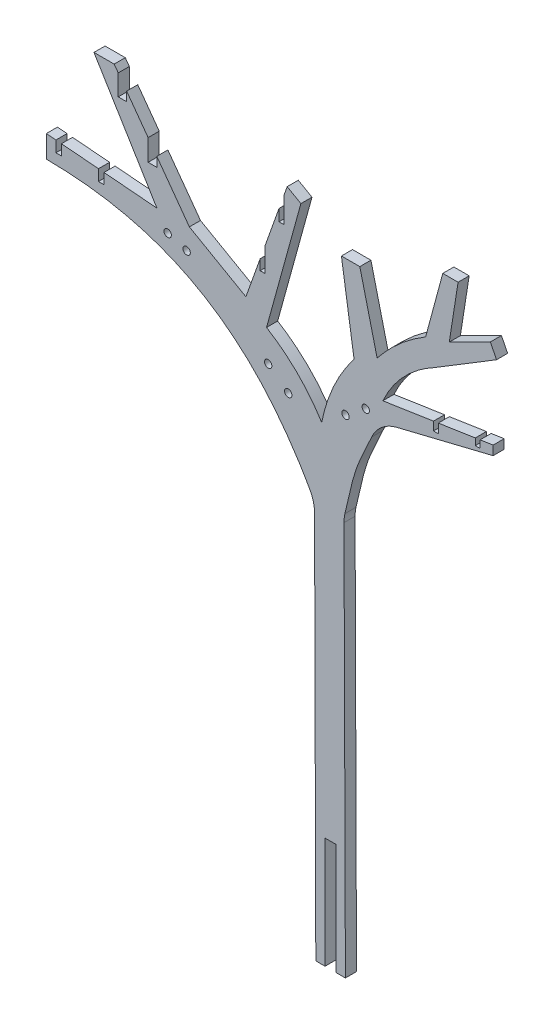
ISO-10303-21;
HEADER;
FILE_DESCRIPTION(('STEP AP214'),'2;1');
FILE_NAME('part.step','',(''),(''),'','','');
FILE_SCHEMA(('AUTOMOTIVE_DESIGN { 1 0 10303 214 1 1 1 1 }'));
ENDSEC;
DATA;
#1=APPLICATION_CONTEXT('core data for automotive mechanical design processes');
#2=APPLICATION_PROTOCOL_DEFINITION('international standard','automotive_design',2000,#1);
#3=PRODUCT_CONTEXT('',#1,'mechanical');
#4=PRODUCT('Part','Part','',(#3));
#5=PRODUCT_RELATED_PRODUCT_CATEGORY('part','',(#4));
#6=PRODUCT_DEFINITION_FORMATION('','',#4);
#7=PRODUCT_DEFINITION_CONTEXT('part definition',#1,'design');
#8=PRODUCT_DEFINITION('design','',#6,#7);
#9=PRODUCT_DEFINITION_SHAPE('','',#8);
#10=(LENGTH_UNIT() NAMED_UNIT(*) SI_UNIT(.MILLI.,.METRE.));
#11=(NAMED_UNIT(*) PLANE_ANGLE_UNIT() SI_UNIT($,.RADIAN.));
#12=(NAMED_UNIT(*) SI_UNIT($,.STERADIAN.) SOLID_ANGLE_UNIT());
#13=UNCERTAINTY_MEASURE_WITH_UNIT(LENGTH_MEASURE(1.E-05),#10,'distance_accuracy_value','');
#14=(GEOMETRIC_REPRESENTATION_CONTEXT(3) GLOBAL_UNCERTAINTY_ASSIGNED_CONTEXT((#13)) GLOBAL_UNIT_ASSIGNED_CONTEXT((#10,
#11,#12)) REPRESENTATION_CONTEXT('',''));
#15=CARTESIAN_POINT('',(0.,0.,0.));
#16=DIRECTION('',(0.,0.,1.));
#17=DIRECTION('',(1.,0.,0.));
#18=AXIS2_PLACEMENT_3D('',#15,#16,#17);
#19=CARTESIAN_POINT('',(2.5166359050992,61.0499646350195,3.));
#20=DIRECTION('',(0.,1.,0.));
#21=DIRECTION('',(0.,0.,1.));
#22=AXIS2_PLACEMENT_3D('',#19,#20,#21);
#23=PLANE('',#22);
#24=DIRECTION('',(1.,0.,0.));
#25=VECTOR('',#24,1.);
#26=CARTESIAN_POINT('',(2.5166359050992,61.0499646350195,0.));
#27=LINE('',#26,#25);
#28=CARTESIAN_POINT('',(2.5166359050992,61.0499646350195,0.));
#29=VERTEX_POINT('',#28);
#30=CARTESIAN_POINT('',(5.0166359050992,61.0499646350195,0.));
#31=VERTEX_POINT('',#30);
#32=EDGE_CURVE('E483',#29,#31,#27,.T.);
#33=ORIENTED_EDGE('',*,*,#32,.T.);
#34=DIRECTION('',(0.,0.,1.));
#35=VECTOR('',#34,1.);
#36=CARTESIAN_POINT('',(5.0166359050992,61.0499646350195,-7.));
#37=LINE('',#36,#35);
#38=CARTESIAN_POINT('',(5.0166359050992,61.0499646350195,3.));
#39=VERTEX_POINT('',#38);
#40=EDGE_CURVE('E467',#31,#39,#37,.T.);
#41=ORIENTED_EDGE('',*,*,#40,.T.);
#42=DIRECTION('',(1.,0.,0.));
#43=VECTOR('',#42,1.);
#44=CARTESIAN_POINT('',(2.5166359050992,61.0499646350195,3.));
#45=LINE('',#44,#43);
#46=CARTESIAN_POINT('',(2.5166359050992,61.0499646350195,3.));
#47=VERTEX_POINT('',#46);
#48=EDGE_CURVE('E481',#47,#39,#45,.T.);
#49=ORIENTED_EDGE('',*,*,#48,.F.);
#50=DIRECTION('',(0.,0.,-1.));
#51=VECTOR('',#50,1.);
#52=CARTESIAN_POINT('',(2.5166359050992,61.0499646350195,3.));
#53=LINE('',#52,#51);
#54=EDGE_CURVE('E606',#47,#29,#53,.T.);
#55=ORIENTED_EDGE('',*,*,#54,.T.);
#56=EDGE_LOOP('',(#33,#41,#49,#55));
#57=FACE_BOUND('',#56,.T.);
#58=ADVANCED_FACE('F35',(#57),#23,.F.);
#59=CARTESIAN_POINT('',(20.6343285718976,201.1978968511,3.));
#60=DIRECTION('',(0.150340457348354,-0.988634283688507,0.));
#61=DIRECTION('',(0.988634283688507,0.150340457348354,0.));
#62=AXIS2_PLACEMENT_3D('',#59,#60,#61);
#63=PLANE('',#62);
#64=DIRECTION('',(-0.988634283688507,-0.150340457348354,0.));
#65=VECTOR('',#64,1.);
#66=CARTESIAN_POINT('',(20.6343285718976,201.1978968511,3.));
#67=LINE('',#66,#65);
#68=CARTESIAN_POINT('',(45.6133653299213,204.996429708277,3.));
#69=VERTEX_POINT('',#68);
#70=CARTESIAN_POINT('',(35.6133653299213,203.475741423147,3.));
#71=VERTEX_POINT('',#70);
#72=EDGE_CURVE('E1483',#69,#71,#67,.T.);
#73=ORIENTED_EDGE('',*,*,#72,.F.);
#74=DIRECTION('',(0.,0.,-1.));
#75=VECTOR('',#74,1.);
#76=CARTESIAN_POINT('',(45.6133653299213,204.996429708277,3.));
#77=LINE('',#76,#75);
#78=CARTESIAN_POINT('',(45.6133653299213,204.996429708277,0.));
#79=VERTEX_POINT('',#78);
#80=EDGE_CURVE('E1087',#69,#79,#77,.T.);
#81=ORIENTED_EDGE('',*,*,#80,.T.);
#82=DIRECTION('',(-0.988634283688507,-0.150340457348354,0.));
#83=VECTOR('',#82,1.);
#84=CARTESIAN_POINT('',(20.6343285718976,201.1978968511,0.));
#85=LINE('',#84,#83);
#86=CARTESIAN_POINT('',(35.6133653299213,203.475741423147,0.));
#87=VERTEX_POINT('',#86);
#88=EDGE_CURVE('E574',#79,#87,#85,.T.);
#89=ORIENTED_EDGE('',*,*,#88,.T.);
#90=DIRECTION('',(0.,0.,1.));
#91=VECTOR('',#90,1.);
#92=CARTESIAN_POINT('',(35.6133653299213,203.475741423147,0.));
#93=LINE('',#92,#91);
#94=EDGE_CURVE('E897',#87,#71,#93,.T.);
#95=ORIENTED_EDGE('',*,*,#94,.T.);
#96=EDGE_LOOP('',(#73,#81,#89,#95));
#97=FACE_BOUND('',#96,.T.);
#98=ADVANCED_FACE('F532',(#97),#63,.F.);
#99=CARTESIAN_POINT('',(34.3133653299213,203.27805194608,3.));
#100=VERTEX_POINT('',#99);
#101=CARTESIAN_POINT('',(20.6343285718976,201.1978968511,3.));
#102=VERTEX_POINT('',#101);
#103=EDGE_CURVE('E1486',#100,#102,#67,.T.);
#104=ORIENTED_EDGE('',*,*,#103,.F.);
#105=DIRECTION('',(0.,0.,-1.));
#106=VECTOR('',#105,1.);
#107=CARTESIAN_POINT('',(34.3133653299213,203.27805194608,3.));
#108=LINE('',#107,#106);
#109=CARTESIAN_POINT('',(34.3133653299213,203.27805194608,0.));
#110=VERTEX_POINT('',#109);
#111=EDGE_CURVE('E1069',#100,#110,#108,.T.);
#112=ORIENTED_EDGE('',*,*,#111,.T.);
#113=CARTESIAN_POINT('',(20.6343285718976,201.1978968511,0.));
#114=VERTEX_POINT('',#113);
#115=EDGE_CURVE('E576',#110,#114,#85,.T.);
#116=ORIENTED_EDGE('',*,*,#115,.T.);
#117=DIRECTION('',(0.,0.,-1.));
#118=VECTOR('',#117,1.);
#119=CARTESIAN_POINT('',(20.6343285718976,201.1978968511,3.));
#120=LINE('',#119,#118);
#121=EDGE_CURVE('E820',#102,#114,#120,.T.);
#122=ORIENTED_EDGE('',*,*,#121,.F.);
#123=EDGE_LOOP('',(#104,#112,#116,#122));
#124=FACE_BOUND('',#123,.T.);
#125=ADVANCED_FACE('F536',(#124),#63,.F.);
#126=CARTESIAN_POINT('',(-16.3778485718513,207.037706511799,3.));
#127=DIRECTION('',(0.942088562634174,-0.335364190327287,0.));
#128=DIRECTION('',(0.335364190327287,0.942088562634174,0.));
#129=AXIS2_PLACEMENT_3D('',#126,#127,#128);
#130=PLANE('',#129);
#131=DIRECTION('',(-0.335364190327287,-0.942088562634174,0.));
#132=VECTOR('',#131,1.);
#133=CARTESIAN_POINT('',(-16.3778485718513,207.037706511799,3.));
#134=LINE('',#133,#132);
#135=CARTESIAN_POINT('',(-12.523765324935,217.86440730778,3.));
#136=VERTEX_POINT('',#135);
#137=CARTESIAN_POINT('',(-16.3778485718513,207.037706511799,3.));
#138=VERTEX_POINT('',#137);
#139=EDGE_CURVE('E692',#136,#138,#134,.T.);
#140=ORIENTED_EDGE('',*,*,#139,.F.);
#141=DIRECTION('',(0.,0.,-1.));
#142=VECTOR('',#141,1.);
#143=CARTESIAN_POINT('',(-12.523765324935,217.86440730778,3.));
#144=LINE('',#143,#142);
#145=CARTESIAN_POINT('',(-12.523765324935,217.86440730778,0.));
#146=VERTEX_POINT('',#145);
#147=EDGE_CURVE('E1079',#136,#146,#144,.T.);
#148=ORIENTED_EDGE('',*,*,#147,.T.);
#149=DIRECTION('',(-0.335364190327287,-0.942088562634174,0.));
#150=VECTOR('',#149,1.);
#151=CARTESIAN_POINT('',(-16.3778485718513,207.037706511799,0.));
#152=LINE('',#151,#150);
#153=CARTESIAN_POINT('',(-16.3778485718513,207.037706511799,0.));
#154=VERTEX_POINT('',#153);
#155=EDGE_CURVE('E1558',#146,#154,#152,.T.);
#156=ORIENTED_EDGE('',*,*,#155,.T.);
#157=DIRECTION('',(0.,0.,-1.));
#158=VECTOR('',#157,1.);
#159=CARTESIAN_POINT('',(-16.3778485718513,207.037706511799,3.));
#160=LINE('',#159,#158);
#161=EDGE_CURVE('E772',#138,#154,#160,.T.);
#162=ORIENTED_EDGE('',*,*,#161,.F.);
#163=EDGE_LOOP('',(#140,#148,#156,#162));
#164=FACE_BOUND('',#163,.T.);
#165=ADVANCED_FACE('F543',(#164),#130,.F.);
#166=CARTESIAN_POINT('',(-7.42291629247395,232.193461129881,0.));
#167=VERTEX_POINT('',#166);
#168=CARTESIAN_POINT('',(-11.223765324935,221.516303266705,0.));
#169=VERTEX_POINT('',#168);
#170=EDGE_CURVE('E1604',#167,#169,#152,.T.);
#171=ORIENTED_EDGE('',*,*,#170,.T.);
#172=DIRECTION('',(0.,0.,1.));
#173=VECTOR('',#172,1.);
#174=CARTESIAN_POINT('',(-11.223765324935,221.516303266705,0.));
#175=LINE('',#174,#173);
#176=CARTESIAN_POINT('',(-11.223765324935,221.516303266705,3.));
#177=VERTEX_POINT('',#176);
#178=EDGE_CURVE('E963',#169,#177,#175,.T.);
#179=ORIENTED_EDGE('',*,*,#178,.T.);
#180=CARTESIAN_POINT('',(-7.42291629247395,232.193461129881,3.));
#181=VERTEX_POINT('',#180);
#182=EDGE_CURVE('E697',#181,#177,#134,.T.);
#183=ORIENTED_EDGE('',*,*,#182,.F.);
#184=DIRECTION('',(0.,0.,-1.));
#185=VECTOR('',#184,1.);
#186=CARTESIAN_POINT('',(-7.42291629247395,232.193461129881,3.));
#187=LINE('',#186,#185);
#188=EDGE_CURVE('E1073',#181,#167,#187,.T.);
#189=ORIENTED_EDGE('',*,*,#188,.T.);
#190=EDGE_LOOP('',(#171,#179,#183,#189));
#191=FACE_BOUND('',#190,.T.);
#192=ADVANCED_FACE('F659',(#191),#130,.F.);
#193=CARTESIAN_POINT('',(-51.9703300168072,243.694191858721,3.));
#194=DIRECTION('',(-0.80867518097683,-0.588255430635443,0.));
#195=DIRECTION('',(0.588255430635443,-0.80867518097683,0.));
#196=AXIS2_PLACEMENT_3D('',#193,#194,#195);
#197=PLANE('',#196);
#198=DIRECTION('',(-0.588255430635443,0.80867518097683,0.));
#199=VECTOR('',#198,1.);
#200=CARTESIAN_POINT('',(-51.9703300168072,243.694191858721,3.));
#201=LINE('',#200,#199);
#202=CARTESIAN_POINT('',(-42.7935607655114,231.078880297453,3.));
#203=VERTEX_POINT('',#202);
#204=CARTESIAN_POINT('',(-48.5973626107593,239.057371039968,3.));
#205=VERTEX_POINT('',#204);
#206=EDGE_CURVE('E709',#203,#205,#201,.T.);
#207=ORIENTED_EDGE('',*,*,#206,.F.);
#208=DIRECTION('',(0.,0.,1.));
#209=VECTOR('',#208,1.);
#210=CARTESIAN_POINT('',(-42.7935607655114,231.078880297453,0.));
#211=LINE('',#210,#209);
#212=CARTESIAN_POINT('',(-42.7935607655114,231.078880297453,0.));
#213=VERTEX_POINT('',#212);
#214=EDGE_CURVE('E884',#213,#203,#211,.T.);
#215=ORIENTED_EDGE('',*,*,#214,.F.);
#216=DIRECTION('',(-0.588255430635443,0.80867518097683,0.));
#217=VECTOR('',#216,1.);
#218=CARTESIAN_POINT('',(-51.9703300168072,243.694191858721,0.));
#219=LINE('',#218,#217);
#220=CARTESIAN_POINT('',(-48.5973626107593,239.057371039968,0.));
#221=VERTEX_POINT('',#220);
#222=EDGE_CURVE('E1594',#213,#221,#219,.T.);
#223=ORIENTED_EDGE('',*,*,#222,.T.);
#224=DIRECTION('',(0.,0.,1.));
#225=VECTOR('',#224,1.);
#226=CARTESIAN_POINT('',(-48.5973626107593,239.057371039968,3.));
#227=LINE('',#226,#225);
#228=EDGE_CURVE('E1076',#221,#205,#227,.T.);
#229=ORIENTED_EDGE('',*,*,#228,.T.);
#230=EDGE_LOOP('',(#207,#215,#223,#229));
#231=FACE_BOUND('',#230,.T.);
#232=ADVANCED_FACE('F649',(#231),#197,.F.);
#233=CARTESIAN_POINT('',(-50.8700385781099,242.181620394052,3.));
#234=VERTEX_POINT('',#233);
#235=CARTESIAN_POINT('',(-51.9703300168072,243.694191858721,3.));
#236=VERTEX_POINT('',#235);
#237=EDGE_CURVE('E701',#234,#236,#201,.T.);
#238=ORIENTED_EDGE('',*,*,#237,.F.);
#239=DIRECTION('',(0.,0.,1.));
#240=VECTOR('',#239,1.);
#241=CARTESIAN_POINT('',(-50.8700385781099,242.181620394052,0.));
#242=LINE('',#241,#240);
#243=CARTESIAN_POINT('',(-50.8700385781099,242.181620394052,0.));
#244=VERTEX_POINT('',#243);
#245=EDGE_CURVE('E923',#244,#234,#242,.T.);
#246=ORIENTED_EDGE('',*,*,#245,.F.);
#247=CARTESIAN_POINT('',(-51.9703300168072,243.694191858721,0.));
#248=VERTEX_POINT('',#247);
#249=EDGE_CURVE('E1585',#244,#248,#219,.T.);
#250=ORIENTED_EDGE('',*,*,#249,.T.);
#251=DIRECTION('',(0.,0.,-1.));
#252=VECTOR('',#251,1.);
#253=CARTESIAN_POINT('',(-51.9703300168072,243.694191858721,3.));
#254=LINE('',#253,#252);
#255=EDGE_CURVE('E766',#236,#248,#254,.T.);
#256=ORIENTED_EDGE('',*,*,#255,.F.);
#257=EDGE_LOOP('',(#238,#246,#250,#256));
#258=FACE_BOUND('',#257,.T.);
#259=ADVANCED_FACE('F650',(#258),#197,.F.);
#260=CARTESIAN_POINT('',(-70.300056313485,218.278545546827,3.));
#261=DIRECTION('',(-0.0841808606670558,-0.996450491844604,0.));
#262=DIRECTION('',(0.996450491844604,-0.0841808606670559,0.));
#263=AXIS2_PLACEMENT_3D('',#260,#261,#262);
#264=PLANE('',#263);
#265=DIRECTION('',(-0.996450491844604,0.0841808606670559,0.));
#266=VECTOR('',#265,1.);
#267=CARTESIAN_POINT('',(-70.300056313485,218.278545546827,3.));
#268=LINE('',#267,#266);
#269=CARTESIAN_POINT('',(-67.7161664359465,218.060256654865,3.));
#270=VERTEX_POINT('',#269);
#271=CARTESIAN_POINT('',(-70.300056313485,218.278545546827,3.));
#272=VERTEX_POINT('',#271);
#273=EDGE_CURVE('E712',#270,#272,#268,.T.);
#274=ORIENTED_EDGE('',*,*,#273,.F.);
#275=DIRECTION('',(0.,0.,1.));
#276=VECTOR('',#275,1.);
#277=CARTESIAN_POINT('',(-67.7161664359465,218.060256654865,0.));
#278=LINE('',#277,#276);
#279=CARTESIAN_POINT('',(-67.7161664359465,218.060256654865,0.));
#280=VERTEX_POINT('',#279);
#281=EDGE_CURVE('E998',#280,#270,#278,.T.);
#282=ORIENTED_EDGE('',*,*,#281,.F.);
#283=DIRECTION('',(-0.996450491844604,0.0841808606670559,0.));
#284=VECTOR('',#283,1.);
#285=CARTESIAN_POINT('',(-70.300056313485,218.278545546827,0.));
#286=LINE('',#285,#284);
#287=CARTESIAN_POINT('',(-70.300056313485,218.278545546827,0.));
#288=VERTEX_POINT('',#287);
#289=EDGE_CURVE('E732',#280,#288,#286,.T.);
#290=ORIENTED_EDGE('',*,*,#289,.T.);
#291=DIRECTION('',(0.,0.,-1.));
#292=VECTOR('',#291,1.);
#293=CARTESIAN_POINT('',(-70.300056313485,218.278545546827,3.));
#294=LINE('',#293,#292);
#295=EDGE_CURVE('E730',#272,#288,#294,.T.);
#296=ORIENTED_EDGE('',*,*,#295,.F.);
#297=EDGE_LOOP('',(#274,#282,#290,#296));
#298=FACE_BOUND('',#297,.T.);
#299=ADVANCED_FACE('F636',(#298),#264,.F.);
#300=CARTESIAN_POINT('',(-56.2161664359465,217.088728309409,0.));
#301=VERTEX_POINT('',#300);
#302=CARTESIAN_POINT('',(-66.2161664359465,217.933535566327,0.));
#303=VERTEX_POINT('',#302);
#304=EDGE_CURVE('E1096',#301,#303,#286,.T.);
#305=ORIENTED_EDGE('',*,*,#304,.T.);
#306=DIRECTION('',(0.,0.,1.));
#307=VECTOR('',#306,1.);
#308=CARTESIAN_POINT('',(-66.2161664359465,217.933535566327,3.));
#309=LINE('',#308,#307);
#310=CARTESIAN_POINT('',(-66.2161664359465,217.933535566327,3.));
#311=VERTEX_POINT('',#310);
#312=EDGE_CURVE('E498',#303,#311,#309,.T.);
#313=ORIENTED_EDGE('',*,*,#312,.T.);
#314=CARTESIAN_POINT('',(-56.2161664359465,217.088728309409,3.));
#315=VERTEX_POINT('',#314);
#316=EDGE_CURVE('E715',#315,#311,#268,.T.);
#317=ORIENTED_EDGE('',*,*,#316,.F.);
#318=DIRECTION('',(0.,0.,1.));
#319=VECTOR('',#318,1.);
#320=CARTESIAN_POINT('',(-56.2161664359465,217.088728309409,0.));
#321=LINE('',#320,#319);
#322=EDGE_CURVE('E1032',#301,#315,#321,.T.);
#323=ORIENTED_EDGE('',*,*,#322,.F.);
#324=EDGE_LOOP('',(#305,#313,#317,#323));
#325=FACE_BOUND('',#324,.T.);
#326=ADVANCED_FACE('F529',(#325),#264,.F.);
#327=CARTESIAN_POINT('',(8.0166359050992,61.0499646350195,3.));
#328=VERTEX_POINT('',#327);
#329=CARTESIAN_POINT('',(10.5166359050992,61.0499646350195,3.));
#330=VERTEX_POINT('',#329);
#331=EDGE_CURVE('E492',#328,#330,#45,.T.);
#332=ORIENTED_EDGE('',*,*,#331,.F.);
#333=DIRECTION('',(0.,0.,1.));
#334=VECTOR('',#333,1.);
#335=CARTESIAN_POINT('',(8.0166359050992,61.0499646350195,-7.));
#336=LINE('',#335,#334);
#337=CARTESIAN_POINT('',(8.0166359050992,61.0499646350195,0.));
#338=VERTEX_POINT('',#337);
#339=EDGE_CURVE('E484',#338,#328,#336,.T.);
#340=ORIENTED_EDGE('',*,*,#339,.F.);
#341=CARTESIAN_POINT('',(10.5166359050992,61.0499646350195,0.));
#342=VERTEX_POINT('',#341);
#343=EDGE_CURVE('E604',#338,#342,#27,.T.);
#344=ORIENTED_EDGE('',*,*,#343,.T.);
#345=DIRECTION('',(0.,0.,-1.));
#346=VECTOR('',#345,1.);
#347=CARTESIAN_POINT('',(10.5166359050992,61.0499646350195,3.));
#348=LINE('',#347,#346);
#349=EDGE_CURVE('E837',#330,#342,#348,.T.);
#350=ORIENTED_EDGE('',*,*,#349,.F.);
#351=EDGE_LOOP('',(#332,#340,#344,#350));
#352=FACE_BOUND('',#351,.T.);
#353=ADVANCED_FACE('F37',(#352),#23,.F.);
#354=CARTESIAN_POINT('',(10.5166359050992,61.0499646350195,3.));
#355=DIRECTION('',(-0.999993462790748,-0.00361585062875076,0.));
#356=DIRECTION('',(0.00361585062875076,-0.999993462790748,0.));
#357=AXIS2_PLACEMENT_3D('',#354,#355,#356);
#358=PLANE('',#357);
#359=DIRECTION('',(-0.00361585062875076,0.999993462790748,0.));
#360=VECTOR('',#359,1.);
#361=CARTESIAN_POINT('',(10.5166359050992,61.0499646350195,0.));
#362=LINE('',#361,#360);
#363=CARTESIAN_POINT('',(10.1319958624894,167.425356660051,0.));
#364=VERTEX_POINT('',#363);
#365=EDGE_CURVE('E601',#342,#364,#362,.T.);
#366=ORIENTED_EDGE('',*,*,#365,.T.);
#367=DIRECTION('',(0.,0.,-1.));
#368=VECTOR('',#367,1.);
#369=CARTESIAN_POINT('',(10.1319958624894,167.425356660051,3.));
#370=LINE('',#369,#368);
#371=CARTESIAN_POINT('',(10.1319958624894,167.425356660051,3.));
#372=VERTEX_POINT('',#371);
#373=EDGE_CURVE('E834',#372,#364,#370,.T.);
#374=ORIENTED_EDGE('',*,*,#373,.F.);
#375=DIRECTION('',(-0.00361585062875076,0.999993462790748,0.));
#376=VECTOR('',#375,1.);
#377=CARTESIAN_POINT('',(10.5166359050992,61.0499646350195,3.));
#378=LINE('',#377,#376);
#379=EDGE_CURVE('E491',#330,#372,#378,.T.);
#380=ORIENTED_EDGE('',*,*,#379,.F.);
#381=ORIENTED_EDGE('',*,*,#349,.T.);
#382=EDGE_LOOP('',(#366,#374,#380,#381));
#383=FACE_BOUND('',#382,.T.);
#384=ADVANCED_FACE('F522',(#383),#358,.F.);
#385=CARTESIAN_POINT('',(20.1319304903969,167.461515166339,3.));
#386=DIRECTION('',(0.,0.,-1.));
#387=DIRECTION('',(-1.,0.,0.));
#388=AXIS2_PLACEMENT_3D('',#385,#386,#387);
#389=CYLINDRICAL_SURFACE('',#388,10.);
#390=CARTESIAN_POINT('',(20.1319304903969,167.461515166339,0.));
#391=DIRECTION('',(0.,0.,-1.));
#392=DIRECTION('',(-1.,0.,0.));
#393=AXIS2_PLACEMENT_3D('',#390,#391,#392);
#394=CIRCLE('',#393,10.);
#395=CARTESIAN_POINT('',(10.3749067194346,169.6525165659,0.));
#396=VERTEX_POINT('',#395);
#397=EDGE_CURVE('E596',#364,#396,#394,.T.);
#398=ORIENTED_EDGE('',*,*,#397,.T.);
#399=DIRECTION('',(0.,0.,-1.));
#400=VECTOR('',#399,1.);
#401=CARTESIAN_POINT('',(10.3749067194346,169.6525165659,3.));
#402=LINE('',#401,#400);
#403=CARTESIAN_POINT('',(10.3749067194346,169.6525165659,3.));
#404=VERTEX_POINT('',#403);
#405=EDGE_CURVE('E831',#404,#396,#402,.T.);
#406=ORIENTED_EDGE('',*,*,#405,.F.);
#407=CARTESIAN_POINT('',(20.1319304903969,167.461515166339,3.));
#408=DIRECTION('',(0.,0.,-1.));
#409=DIRECTION('',(-1.,0.,0.));
#410=AXIS2_PLACEMENT_3D('',#407,#408,#409);
#411=CIRCLE('',#410,10.);
#412=EDGE_CURVE('E494',#372,#404,#411,.T.);
#413=ORIENTED_EDGE('',*,*,#412,.F.);
#414=ORIENTED_EDGE('',*,*,#373,.T.);
#415=EDGE_LOOP('',(#398,#406,#413,#414));
#416=FACE_BOUND('',#415,.T.);
#417=ADVANCED_FACE('F518',(#416),#389,.F.);
#418=CARTESIAN_POINT('',(10.3749067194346,169.6525165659,3.));
#419=CARTESIAN_POINT('',(12.3606277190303,178.495380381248,3.));
#420=CARTESIAN_POINT('',(13.3153549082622,182.026541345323,3.));
#421=CARTESIAN_POINT('',(16.095725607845,187.806098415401,3.));
#422=CARTESIAN_POINT('',(17.6107593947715,191.207392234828,3.));
#423=B_SPLINE_CURVE_WITH_KNOTS('',3,(#418,#419,#420,#421,#422),.UNSPECIFIED.,.F.,.F.,(4,1,4),
(0.0943156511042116,0.680602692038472,0.983634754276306),.UNSPECIFIED.);
#424=DIRECTION('',(0.,0.,-1.));
#425=VECTOR('',#424,1.);
#426=SURFACE_OF_LINEAR_EXTRUSION('',#423,#425);
#427=CARTESIAN_POINT('',(10.3749067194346,169.6525165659,0.));
#428=CARTESIAN_POINT('',(12.3606277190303,178.495380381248,0.));
#429=CARTESIAN_POINT('',(13.3153549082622,182.026541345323,0.));
#430=CARTESIAN_POINT('',(16.095725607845,187.806098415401,0.));
#431=CARTESIAN_POINT('',(17.6107593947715,191.207392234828,0.));
#432=B_SPLINE_CURVE_WITH_KNOTS('',3,(#427,#428,#429,#430,#431),.UNSPECIFIED.,.F.,.F.,(4,1,4),
(0.0943156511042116,0.680602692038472,0.983634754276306),.UNSPECIFIED.);
#433=CARTESIAN_POINT('',(17.6107593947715,191.207392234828,0.));
#434=VERTEX_POINT('',#433);
#435=EDGE_CURVE('E592',#396,#434,#432,.T.);
#436=ORIENTED_EDGE('',*,*,#435,.T.);
#437=DIRECTION('',(0.,0.,-1.));
#438=VECTOR('',#437,1.);
#439=CARTESIAN_POINT('',(17.6107593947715,191.207392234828,3.));
#440=LINE('',#439,#438);
#441=CARTESIAN_POINT('',(17.6107593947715,191.207392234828,3.));
#442=VERTEX_POINT('',#441);
#443=EDGE_CURVE('E828',#442,#434,#440,.T.);
#444=ORIENTED_EDGE('',*,*,#443,.F.);
#445=EDGE_CURVE('E502',#404,#442,#423,.T.);
#446=ORIENTED_EDGE('',*,*,#445,.F.);
#447=ORIENTED_EDGE('',*,*,#405,.T.);
#448=EDGE_LOOP('',(#436,#444,#446,#447));
#449=FACE_BOUND('',#448,.T.);
#450=ADVANCED_FACE('F513',(#449),#426,.F.);
#451=CARTESIAN_POINT('',(26.7455350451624,187.138501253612,3.));
#452=DIRECTION('',(0.,0.,-1.));
#453=DIRECTION('',(-1.,0.,0.));
#454=AXIS2_PLACEMENT_3D('',#451,#452,#453);
#455=CYLINDRICAL_SURFACE('',#454,10.);
#456=CARTESIAN_POINT('',(26.7455350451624,187.138501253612,0.));
#457=DIRECTION('',(0.,0.,-1.));
#458=DIRECTION('',(1.,0.,0.));
#459=AXIS2_PLACEMENT_3D('',#456,#457,#458);
#460=CIRCLE('',#459,10.);
#461=CARTESIAN_POINT('',(24.3641933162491,196.850823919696,0.));
#462=VERTEX_POINT('',#461);
#463=EDGE_CURVE('E588',#434,#462,#460,.T.);
#464=ORIENTED_EDGE('',*,*,#463,.T.);
#465=DIRECTION('',(0.,0.,-1.));
#466=VECTOR('',#465,1.);
#467=CARTESIAN_POINT('',(24.3641933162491,196.850823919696,3.));
#468=LINE('',#467,#466);
#469=CARTESIAN_POINT('',(24.3641933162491,196.850823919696,3.));
#470=VERTEX_POINT('',#469);
#471=EDGE_CURVE('E825',#470,#462,#468,.T.);
#472=ORIENTED_EDGE('',*,*,#471,.F.);
#473=CARTESIAN_POINT('',(26.7455350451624,187.138501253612,3.));
#474=DIRECTION('',(0.,0.,-1.));
#475=DIRECTION('',(1.,0.,0.));
#476=AXIS2_PLACEMENT_3D('',#473,#474,#475);
#477=CIRCLE('',#476,10.);
#478=EDGE_CURVE('E507',#442,#470,#477,.T.);
#479=ORIENTED_EDGE('',*,*,#478,.F.);
#480=ORIENTED_EDGE('',*,*,#443,.T.);
#481=EDGE_LOOP('',(#464,#472,#479,#480));
#482=FACE_BOUND('',#481,.T.);
#483=ADVANCED_FACE('F517',(#482),#455,.F.);
#484=CARTESIAN_POINT('',(50.4311267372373,203.242114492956,3.));
#485=DIRECTION('',(-0.238134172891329,0.971232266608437,0.));
#486=DIRECTION('',(-0.971232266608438,-0.238134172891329,0.));
#487=AXIS2_PLACEMENT_3D('',#484,#485,#486);
#488=PLANE('',#487);
#489=DIRECTION('',(0.971232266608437,0.238134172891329,0.));
#490=VECTOR('',#489,1.);
#491=CARTESIAN_POINT('',(50.4311267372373,203.242114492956,0.));
#492=LINE('',#491,#490);
#493=CARTESIAN_POINT('',(50.4311267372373,203.242114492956,0.));
#494=VERTEX_POINT('',#493);
#495=EDGE_CURVE('E586',#462,#494,#492,.T.);
#496=ORIENTED_EDGE('',*,*,#495,.T.);
#497=DIRECTION('',(0.,0.,-1.));
#498=VECTOR('',#497,1.);
#499=CARTESIAN_POINT('',(50.4311267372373,203.242114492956,3.));
#500=LINE('',#499,#498);
#501=CARTESIAN_POINT('',(50.4311267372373,203.242114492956,3.));
#502=VERTEX_POINT('',#501);
#503=EDGE_CURVE('E823',#502,#494,#500,.T.);
#504=ORIENTED_EDGE('',*,*,#503,.F.);
#505=DIRECTION('',(0.971232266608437,0.238134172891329,0.));
#506=VECTOR('',#505,1.);
#507=CARTESIAN_POINT('',(50.4311267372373,203.242114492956,3.));
#508=LINE('',#507,#506);
#509=EDGE_CURVE('E1982',#470,#502,#508,.T.);
#510=ORIENTED_EDGE('',*,*,#509,.F.);
#511=ORIENTED_EDGE('',*,*,#471,.T.);
#512=EDGE_LOOP('',(#496,#504,#510,#511));
#513=FACE_BOUND('',#512,.T.);
#514=ADVANCED_FACE('F558',(#513),#488,.F.);
#515=CARTESIAN_POINT('',(50.4311267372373,205.729061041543,3.));
#516=DIRECTION('',(-1.,0.,0.));
#517=DIRECTION('',(0.,0.,1.));
#518=AXIS2_PLACEMENT_3D('',#515,#516,#517);
#519=PLANE('',#518);
#520=DIRECTION('',(0.,1.,0.));
#521=VECTOR('',#520,1.);
#522=CARTESIAN_POINT('',(50.4311267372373,205.729061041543,0.));
#523=LINE('',#522,#521);
#524=CARTESIAN_POINT('',(50.4311267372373,205.729061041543,0.));
#525=VERTEX_POINT('',#524);
#526=EDGE_CURVE('E581',#494,#525,#523,.T.);
#527=ORIENTED_EDGE('',*,*,#526,.T.);
#528=DIRECTION('',(0.,0.,-1.));
#529=VECTOR('',#528,1.);
#530=CARTESIAN_POINT('',(50.4311267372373,205.729061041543,3.));
#531=LINE('',#530,#529);
#532=CARTESIAN_POINT('',(50.4311267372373,205.729061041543,3.));
#533=VERTEX_POINT('',#532);
#534=EDGE_CURVE('E569',#533,#525,#531,.T.);
#535=ORIENTED_EDGE('',*,*,#534,.F.);
#536=DIRECTION('',(0.,1.,0.));
#537=VECTOR('',#536,1.);
#538=CARTESIAN_POINT('',(50.4311267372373,205.729061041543,3.));
#539=LINE('',#538,#537);
#540=EDGE_CURVE('E1489',#502,#533,#539,.T.);
#541=ORIENTED_EDGE('',*,*,#540,.F.);
#542=ORIENTED_EDGE('',*,*,#503,.T.);
#543=EDGE_LOOP('',(#527,#535,#541,#542));
#544=FACE_BOUND('',#543,.T.);
#545=ADVANCED_FACE('F550',(#544),#519,.F.);
#546=CARTESIAN_POINT('',(46.9133653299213,205.194119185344,0.));
#547=VERTEX_POINT('',#546);
#548=EDGE_CURVE('E564',#525,#547,#85,.T.);
#549=ORIENTED_EDGE('',*,*,#548,.T.);
#550=DIRECTION('',(0.,0.,1.));
#551=VECTOR('',#550,1.);
#552=CARTESIAN_POINT('',(46.9133653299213,205.194119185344,0.));
#553=LINE('',#552,#551);
#554=CARTESIAN_POINT('',(46.9133653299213,205.194119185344,3.));
#555=VERTEX_POINT('',#554);
#556=EDGE_CURVE('E566',#547,#555,#553,.T.);
#557=ORIENTED_EDGE('',*,*,#556,.T.);
#558=EDGE_CURVE('E1480',#533,#555,#67,.T.);
#559=ORIENTED_EDGE('',*,*,#558,.F.);
#560=ORIENTED_EDGE('',*,*,#534,.T.);
#561=EDGE_LOOP('',(#549,#557,#559,#560));
#562=FACE_BOUND('',#561,.T.);
#563=ADVANCED_FACE('F539',(#562),#63,.F.);
#564=CARTESIAN_POINT('',(20.6343285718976,201.1978968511,3.));
#565=CARTESIAN_POINT('',(24.9961760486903,210.756152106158,3.));
#566=CARTESIAN_POINT('',(34.5612669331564,215.927531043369,3.));
#567=B_SPLINE_CURVE_WITH_KNOTS('',2,(#564,#565,#566),.UNSPECIFIED.,.F.,.F.,(3,3),(0.,1.),.UNSPECIFIED.);
#568=DIRECTION('',(0.,0.,-1.));
#569=VECTOR('',#568,1.);
#570=SURFACE_OF_LINEAR_EXTRUSION('',#567,#569);
#571=CARTESIAN_POINT('',(20.6343285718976,201.1978968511,0.));
#572=CARTESIAN_POINT('',(24.9961760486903,210.756152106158,0.));
#573=CARTESIAN_POINT('',(34.5612669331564,215.927531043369,0.));
#574=B_SPLINE_CURVE_WITH_KNOTS('',2,(#571,#572,#573),.UNSPECIFIED.,.F.,.F.,(3,3),(0.,1.),.UNSPECIFIED.);
#575=CARTESIAN_POINT('',(34.5612669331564,215.927531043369,0.));
#576=VERTEX_POINT('',#575);
#577=EDGE_CURVE('E573',#114,#576,#574,.T.);
#578=ORIENTED_EDGE('',*,*,#577,.T.);
#579=DIRECTION('',(0.,0.,-1.));
#580=VECTOR('',#579,1.);
#581=CARTESIAN_POINT('',(34.5612669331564,215.927531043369,3.));
#582=LINE('',#581,#580);
#583=CARTESIAN_POINT('',(34.5612669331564,215.927531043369,3.));
#584=VERTEX_POINT('',#583);
#585=EDGE_CURVE('E817',#584,#576,#582,.T.);
#586=ORIENTED_EDGE('',*,*,#585,.F.);
#587=EDGE_CURVE('E1488',#102,#584,#567,.T.);
#588=ORIENTED_EDGE('',*,*,#587,.F.);
#589=ORIENTED_EDGE('',*,*,#121,.T.);
#590=EDGE_LOOP('',(#578,#586,#588,#589));
#591=FACE_BOUND('',#590,.T.);
#592=ADVANCED_FACE('F549',(#591),#570,.F.);
#593=CARTESIAN_POINT('',(51.3622206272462,226.159673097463,3.));
#594=DIRECTION('',(-0.520149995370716,0.854074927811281,0.));
#595=DIRECTION('',(-0.854074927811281,-0.520149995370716,0.));
#596=AXIS2_PLACEMENT_3D('',#593,#594,#595);
#597=PLANE('',#596);
#598=DIRECTION('',(0.854074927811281,0.520149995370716,0.));
#599=VECTOR('',#598,1.);
#600=CARTESIAN_POINT('',(51.3622206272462,226.159673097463,0.));
#601=LINE('',#600,#599);
#602=CARTESIAN_POINT('',(51.3622206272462,226.159673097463,0.));
#603=VERTEX_POINT('',#602);
#604=EDGE_CURVE('E577',#576,#603,#601,.T.);
#605=ORIENTED_EDGE('',*,*,#604,.T.);
#606=DIRECTION('',(0.,0.,-1.));
#607=VECTOR('',#606,1.);
#608=CARTESIAN_POINT('',(51.3622206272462,226.159673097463,3.));
#609=LINE('',#608,#607);
#610=CARTESIAN_POINT('',(51.3622206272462,226.159673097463,3.));
#611=VERTEX_POINT('',#610);
#612=EDGE_CURVE('E814',#611,#603,#609,.T.);
#613=ORIENTED_EDGE('',*,*,#612,.F.);
#614=DIRECTION('',(0.854074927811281,0.520149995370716,0.));
#615=VECTOR('',#614,1.);
#616=CARTESIAN_POINT('',(51.3622206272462,226.159673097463,3.));
#617=LINE('',#616,#615);
#618=EDGE_CURVE('E1496',#584,#611,#617,.T.);
#619=ORIENTED_EDGE('',*,*,#618,.F.);
#620=ORIENTED_EDGE('',*,*,#585,.T.);
#621=EDGE_LOOP('',(#605,#613,#619,#620));
#622=FACE_BOUND('',#621,.T.);
#623=ADVANCED_FACE('F556',(#622),#597,.F.);
#624=CARTESIAN_POINT('',(49.685049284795,229.491603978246,3.));
#625=DIRECTION('',(-0.893222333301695,-0.449615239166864,0.));
#626=DIRECTION('',(0.449615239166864,-0.893222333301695,0.));
#627=AXIS2_PLACEMENT_3D('',#624,#625,#626);
#628=PLANE('',#627);
#629=DIRECTION('',(-0.449615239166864,0.893222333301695,0.));
#630=VECTOR('',#629,1.);
#631=CARTESIAN_POINT('',(49.685049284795,229.491603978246,0.));
#632=LINE('',#631,#630);
#633=CARTESIAN_POINT('',(49.685049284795,229.491603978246,0.));
#634=VERTEX_POINT('',#633);
#635=EDGE_CURVE('E1643',#603,#634,#632,.T.);
#636=ORIENTED_EDGE('',*,*,#635,.T.);
#637=DIRECTION('',(0.,0.,-1.));
#638=VECTOR('',#637,1.);
#639=CARTESIAN_POINT('',(49.685049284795,229.491603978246,3.));
#640=LINE('',#639,#638);
#641=CARTESIAN_POINT('',(49.685049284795,229.491603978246,3.));
#642=VERTEX_POINT('',#641);
#643=EDGE_CURVE('E811',#642,#634,#640,.T.);
#644=ORIENTED_EDGE('',*,*,#643,.F.);
#645=DIRECTION('',(-0.449615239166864,0.893222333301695,0.));
#646=VECTOR('',#645,1.);
#647=CARTESIAN_POINT('',(49.685049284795,229.491603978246,3.));
#648=LINE('',#647,#646);
#649=EDGE_CURVE('E1661',#611,#642,#648,.T.);
#650=ORIENTED_EDGE('',*,*,#649,.F.);
#651=ORIENTED_EDGE('',*,*,#612,.T.);
#652=EDGE_LOOP('',(#636,#644,#650,#651));
#653=FACE_BOUND('',#652,.T.);
#654=ADVANCED_FACE('F1291',(#653),#628,.F.);
#655=CARTESIAN_POINT('',(49.685049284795,229.491603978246,3.));
#656=DIRECTION('',(0.449615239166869,-0.893222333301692,0.));
#657=DIRECTION('',(0.893222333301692,0.449615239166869,0.));
#658=AXIS2_PLACEMENT_3D('',#655,#656,#657);
#659=PLANE('',#658);
#660=CARTESIAN_POINT('',(49.685049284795,229.491603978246,0.));
#661=CARTESIAN_POINT('',(44.1355504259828,226.698190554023,0.));
#662=CARTESIAN_POINT('',(38.5860515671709,223.9047771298,0.));
#663=B_SPLINE_CURVE_WITH_KNOTS('',2,(#660,#661,#662),.UNSPECIFIED.,.F.,.F.,(3,3),(0.,1.),.UNSPECIFIED.);
#664=CARTESIAN_POINT('',(38.5860515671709,223.9047771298,0.));
#665=VERTEX_POINT('',#664);
#666=EDGE_CURVE('E1639',#634,#665,#663,.T.);
#667=ORIENTED_EDGE('',*,*,#666,.T.);
#668=DIRECTION('',(0.,0.,-1.));
#669=VECTOR('',#668,1.);
#670=CARTESIAN_POINT('',(38.5860515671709,223.9047771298,3.));
#671=LINE('',#670,#669);
#672=CARTESIAN_POINT('',(38.5860515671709,223.9047771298,3.));
#673=VERTEX_POINT('',#672);
#674=EDGE_CURVE('E808',#673,#665,#671,.T.);
#675=ORIENTED_EDGE('',*,*,#674,.F.);
#676=CARTESIAN_POINT('',(49.685049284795,229.491603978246,3.));
#677=CARTESIAN_POINT('',(44.1355504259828,226.698190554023,3.));
#678=CARTESIAN_POINT('',(38.5860515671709,223.9047771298,3.));
#679=B_SPLINE_CURVE_WITH_KNOTS('',2,(#676,#677,#678),.UNSPECIFIED.,.F.,.F.,(3,3),(0.,1.),.UNSPECIFIED.);
#680=EDGE_CURVE('E1672',#642,#673,#679,.T.);
#681=ORIENTED_EDGE('',*,*,#680,.F.);
#682=ORIENTED_EDGE('',*,*,#643,.T.);
#683=EDGE_LOOP('',(#667,#675,#681,#682));
#684=FACE_BOUND('',#683,.T.);
#685=ADVANCED_FACE('F1283',(#684),#659,.F.);
#686=CARTESIAN_POINT('',(40.9622884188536,239.113723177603,3.));
#687=DIRECTION('',(-0.988013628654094,0.154366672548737,0.));
#688=DIRECTION('',(-0.154366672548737,-0.988013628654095,0.));
#689=AXIS2_PLACEMENT_3D('',#686,#687,#688);
#690=PLANE('',#689);
#691=DIRECTION('',(0.154366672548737,0.988013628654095,0.));
#692=VECTOR('',#691,1.);
#693=CARTESIAN_POINT('',(40.9622884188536,239.113723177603,0.));
#694=LINE('',#693,#692);
#695=CARTESIAN_POINT('',(40.9622884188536,239.113723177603,0.));
#696=VERTEX_POINT('',#695);
#697=EDGE_CURVE('E1637',#665,#696,#694,.T.);
#698=ORIENTED_EDGE('',*,*,#697,.T.);
#699=DIRECTION('',(0.,0.,-1.));
#700=VECTOR('',#699,1.);
#701=CARTESIAN_POINT('',(40.9622884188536,239.113723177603,3.));
#702=LINE('',#701,#700);
#703=CARTESIAN_POINT('',(40.9622884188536,239.113723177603,3.));
#704=VERTEX_POINT('',#703);
#705=EDGE_CURVE('E805',#704,#696,#702,.T.);
#706=ORIENTED_EDGE('',*,*,#705,.F.);
#707=DIRECTION('',(0.154366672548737,0.988013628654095,0.));
#708=VECTOR('',#707,1.);
#709=CARTESIAN_POINT('',(40.9622884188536,239.113723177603,3.));
#710=LINE('',#709,#708);
#711=EDGE_CURVE('E1669',#673,#704,#710,.T.);
#712=ORIENTED_EDGE('',*,*,#711,.F.);
#713=ORIENTED_EDGE('',*,*,#674,.T.);
#714=EDGE_LOOP('',(#698,#706,#712,#713));
#715=FACE_BOUND('',#714,.T.);
#716=ADVANCED_FACE('F1275',(#715),#690,.F.);
#717=CARTESIAN_POINT('',(36.832861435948,239.113723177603,3.));
#718=DIRECTION('',(0.,-1.,0.));
#719=DIRECTION('',(0.,0.,-1.));
#720=AXIS2_PLACEMENT_3D('',#717,#718,#719);
#721=PLANE('',#720);
#722=DIRECTION('',(-1.,0.,0.));
#723=VECTOR('',#722,1.);
#724=CARTESIAN_POINT('',(36.832861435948,239.113723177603,0.));
#725=LINE('',#724,#723);
#726=CARTESIAN_POINT('',(36.832861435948,239.113723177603,0.));
#727=VERTEX_POINT('',#726);
#728=EDGE_CURVE('E1635',#696,#727,#725,.T.);
#729=ORIENTED_EDGE('',*,*,#728,.T.);
#730=DIRECTION('',(0.,0.,-1.));
#731=VECTOR('',#730,1.);
#732=CARTESIAN_POINT('',(36.832861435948,239.113723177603,3.));
#733=LINE('',#732,#731);
#734=CARTESIAN_POINT('',(36.832861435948,239.113723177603,3.));
#735=VERTEX_POINT('',#734);
#736=EDGE_CURVE('E802',#735,#727,#733,.T.);
#737=ORIENTED_EDGE('',*,*,#736,.F.);
#738=DIRECTION('',(-1.,0.,0.));
#739=VECTOR('',#738,1.);
#740=CARTESIAN_POINT('',(36.832861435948,239.113723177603,3.));
#741=LINE('',#740,#739);
#742=EDGE_CURVE('E1671',#704,#735,#741,.T.);
#743=ORIENTED_EDGE('',*,*,#742,.F.);
#744=ORIENTED_EDGE('',*,*,#705,.T.);
#745=EDGE_LOOP('',(#729,#737,#743,#744));
#746=FACE_BOUND('',#745,.T.);
#747=ADVANCED_FACE('F1267',(#746),#721,.F.);
#748=CARTESIAN_POINT('',(32.197853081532,221.927217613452,3.));
#749=DIRECTION('',(0.965504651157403,-0.260385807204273,0.));
#750=DIRECTION('',(0.260385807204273,0.965504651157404,0.));
#751=AXIS2_PLACEMENT_3D('',#748,#749,#750);
#752=PLANE('',#751);
#753=DIRECTION('',(-0.260385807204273,-0.965504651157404,0.));
#754=VECTOR('',#753,1.);
#755=CARTESIAN_POINT('',(32.197853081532,221.927217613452,0.));
#756=LINE('',#755,#754);
#757=CARTESIAN_POINT('',(32.197853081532,221.927217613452,0.));
#758=VERTEX_POINT('',#757);
#759=EDGE_CURVE('E1630',#727,#758,#756,.T.);
#760=ORIENTED_EDGE('',*,*,#759,.T.);
#761=DIRECTION('',(0.,0.,-1.));
#762=VECTOR('',#761,1.);
#763=CARTESIAN_POINT('',(32.197853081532,221.927217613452,3.));
#764=LINE('',#763,#762);
#765=CARTESIAN_POINT('',(32.197853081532,221.927217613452,3.));
#766=VERTEX_POINT('',#765);
#767=EDGE_CURVE('E799',#766,#758,#764,.T.);
#768=ORIENTED_EDGE('',*,*,#767,.F.);
#769=DIRECTION('',(-0.260385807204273,-0.965504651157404,0.));
#770=VECTOR('',#769,1.);
#771=CARTESIAN_POINT('',(32.197853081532,221.927217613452,3.));
#772=LINE('',#771,#770);
#773=EDGE_CURVE('E1509',#735,#766,#772,.T.);
#774=ORIENTED_EDGE('',*,*,#773,.F.);
#775=ORIENTED_EDGE('',*,*,#736,.T.);
#776=EDGE_LOOP('',(#760,#768,#774,#775));
#777=FACE_BOUND('',#776,.T.);
#778=ADVANCED_FACE('F1259',(#777),#752,.F.);
#779=CARTESIAN_POINT('',(32.197853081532,221.927217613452,3.));
#780=CARTESIAN_POINT('',(24.6018107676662,217.389360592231,3.));
#781=CARTESIAN_POINT('',(19.0918605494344,210.408407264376,3.));
#782=B_SPLINE_CURVE_WITH_KNOTS('',2,(#779,#780,#781),.UNSPECIFIED.,.F.,.F.,(3,3),(0.,1.),.UNSPECIFIED.);
#783=DIRECTION('',(0.,0.,-1.));
#784=VECTOR('',#783,1.);
#785=SURFACE_OF_LINEAR_EXTRUSION('',#782,#784);
#786=CARTESIAN_POINT('',(32.197853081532,221.927217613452,0.));
#787=CARTESIAN_POINT('',(24.6018107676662,217.389360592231,0.));
#788=CARTESIAN_POINT('',(19.0918605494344,210.408407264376,0.));
#789=B_SPLINE_CURVE_WITH_KNOTS('',2,(#786,#787,#788),.UNSPECIFIED.,.F.,.F.,(3,3),(0.,1.),.UNSPECIFIED.);
#790=CARTESIAN_POINT('',(19.0918605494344,210.408407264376,0.));
#791=VERTEX_POINT('',#790);
#792=EDGE_CURVE('E1626',#758,#791,#789,.T.);
#793=ORIENTED_EDGE('',*,*,#792,.T.);
#794=DIRECTION('',(0.,0.,-1.));
#795=VECTOR('',#794,1.);
#796=CARTESIAN_POINT('',(19.0918605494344,210.408407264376,3.));
#797=LINE('',#796,#795);
#798=CARTESIAN_POINT('',(19.0918605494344,210.408407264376,3.));
#799=VERTEX_POINT('',#798);
#800=EDGE_CURVE('E796',#799,#791,#797,.T.);
#801=ORIENTED_EDGE('',*,*,#800,.F.);
#802=EDGE_CURVE('E1502',#766,#799,#782,.T.);
#803=ORIENTED_EDGE('',*,*,#802,.F.);
#804=ORIENTED_EDGE('',*,*,#767,.T.);
#805=EDGE_LOOP('',(#793,#801,#803,#804));
#806=FACE_BOUND('',#805,.T.);
#807=ADVANCED_FACE('F1251',(#806),#785,.F.);
#808=CARTESIAN_POINT('',(14.4128960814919,229.491603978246,3.));
#809=DIRECTION('',(-0.971232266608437,-0.238134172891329,0.));
#810=DIRECTION('',(0.238134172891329,-0.971232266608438,0.));
#811=AXIS2_PLACEMENT_3D('',#808,#809,#810);
#812=PLANE('',#811);
#813=DIRECTION('',(-0.238134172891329,0.971232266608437,0.));
#814=VECTOR('',#813,1.);
#815=CARTESIAN_POINT('',(14.4128960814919,229.491603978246,0.));
#816=LINE('',#815,#814);
#817=CARTESIAN_POINT('',(14.4128960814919,229.491603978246,0.));
#818=VERTEX_POINT('',#817);
#819=EDGE_CURVE('E1624',#791,#818,#816,.T.);
#820=ORIENTED_EDGE('',*,*,#819,.T.);
#821=DIRECTION('',(0.,0.,-1.));
#822=VECTOR('',#821,1.);
#823=CARTESIAN_POINT('',(14.4128960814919,229.491603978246,3.));
#824=LINE('',#823,#822);
#825=CARTESIAN_POINT('',(14.4128960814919,229.491603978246,3.));
#826=VERTEX_POINT('',#825);
#827=EDGE_CURVE('E793',#826,#818,#824,.T.);
#828=ORIENTED_EDGE('',*,*,#827,.F.);
#829=DIRECTION('',(-0.238134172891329,0.971232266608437,0.));
#830=VECTOR('',#829,1.);
#831=CARTESIAN_POINT('',(14.4128960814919,229.491603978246,3.));
#832=LINE('',#831,#830);
#833=EDGE_CURVE('E1508',#799,#826,#832,.T.);
#834=ORIENTED_EDGE('',*,*,#833,.F.);
#835=ORIENTED_EDGE('',*,*,#800,.T.);
#836=EDGE_LOOP('',(#820,#828,#834,#835));
#837=FACE_BOUND('',#836,.T.);
#838=ADVANCED_FACE('F1243',(#837),#812,.F.);
#839=CARTESIAN_POINT('',(9.43923455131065,229.491603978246,3.));
#840=DIRECTION('',(0.,-1.,0.));
#841=DIRECTION('',(0.,0.,-1.));
#842=AXIS2_PLACEMENT_3D('',#839,#840,#841);
#843=PLANE('',#842);
#844=DIRECTION('',(-1.,0.,0.));
#845=VECTOR('',#844,1.);
#846=CARTESIAN_POINT('',(9.43923455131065,229.491603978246,0.));
#847=LINE('',#846,#845);
#848=CARTESIAN_POINT('',(9.43923455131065,229.491603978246,0.));
#849=VERTEX_POINT('',#848);
#850=EDGE_CURVE('E1622',#818,#849,#847,.T.);
#851=ORIENTED_EDGE('',*,*,#850,.T.);
#852=DIRECTION('',(0.,0.,-1.));
#853=VECTOR('',#852,1.);
#854=CARTESIAN_POINT('',(9.43923455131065,229.491603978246,3.));
#855=LINE('',#854,#853);
#856=CARTESIAN_POINT('',(9.43923455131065,229.491603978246,3.));
#857=VERTEX_POINT('',#856);
#858=EDGE_CURVE('E790',#857,#849,#855,.T.);
#859=ORIENTED_EDGE('',*,*,#858,.F.);
#860=DIRECTION('',(-1.,0.,0.));
#861=VECTOR('',#860,1.);
#862=CARTESIAN_POINT('',(9.43923455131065,229.491603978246,3.));
#863=LINE('',#862,#861);
#864=EDGE_CURVE('E1515',#826,#857,#863,.T.);
#865=ORIENTED_EDGE('',*,*,#864,.F.);
#866=ORIENTED_EDGE('',*,*,#827,.T.);
#867=EDGE_LOOP('',(#851,#859,#865,#866));
#868=FACE_BOUND('',#867,.T.);
#869=ADVANCED_FACE('F1236',(#868),#843,.F.);
#870=CARTESIAN_POINT('',(12.8537724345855,207.037706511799,3.));
#871=DIRECTION('',(0.988634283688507,0.150340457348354,0.));
#872=DIRECTION('',(-0.150340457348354,0.988634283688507,0.));
#873=AXIS2_PLACEMENT_3D('',#870,#871,#872);
#874=PLANE('',#873);
#875=DIRECTION('',(0.150340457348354,-0.988634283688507,0.));
#876=VECTOR('',#875,1.);
#877=CARTESIAN_POINT('',(12.8537724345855,207.037706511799,0.));
#878=LINE('',#877,#876);
#879=CARTESIAN_POINT('',(12.8537724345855,207.037706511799,0.));
#880=VERTEX_POINT('',#879);
#881=EDGE_CURVE('E1617',#849,#880,#878,.T.);
#882=ORIENTED_EDGE('',*,*,#881,.T.);
#883=DIRECTION('',(0.,0.,-1.));
#884=VECTOR('',#883,1.);
#885=CARTESIAN_POINT('',(12.8537724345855,207.037706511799,3.));
#886=LINE('',#885,#884);
#887=CARTESIAN_POINT('',(12.8537724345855,207.037706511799,3.));
#888=VERTEX_POINT('',#887);
#889=EDGE_CURVE('E787',#888,#880,#886,.T.);
#890=ORIENTED_EDGE('',*,*,#889,.F.);
#891=DIRECTION('',(0.150340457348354,-0.988634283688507,0.));
#892=VECTOR('',#891,1.);
#893=CARTESIAN_POINT('',(12.8537724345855,207.037706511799,3.));
#894=LINE('',#893,#892);
#895=EDGE_CURVE('E1516',#857,#888,#894,.T.);
#896=ORIENTED_EDGE('',*,*,#895,.F.);
#897=ORIENTED_EDGE('',*,*,#858,.T.);
#898=EDGE_LOOP('',(#882,#890,#896,#897));
#899=FACE_BOUND('',#898,.T.);
#900=ADVANCED_FACE('F1229',(#899),#874,.F.);
#901=CARTESIAN_POINT('',(12.8537724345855,207.037706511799,3.));
#902=CARTESIAN_POINT('',(6.23818241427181,198.495541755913,3.));
#903=CARTESIAN_POINT('',(4.10863078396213,187.873582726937,3.));
#904=B_SPLINE_CURVE_WITH_KNOTS('',2,(#901,#902,#903),.UNSPECIFIED.,.F.,.F.,(3,3),(0.,1.),.UNSPECIFIED.);
#905=DIRECTION('',(0.,0.,-1.));
#906=VECTOR('',#905,1.);
#907=SURFACE_OF_LINEAR_EXTRUSION('',#904,#906);
#908=CARTESIAN_POINT('',(12.8537724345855,207.037706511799,0.));
#909=CARTESIAN_POINT('',(6.23818241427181,198.495541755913,0.));
#910=CARTESIAN_POINT('',(4.10863078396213,187.873582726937,0.));
#911=B_SPLINE_CURVE_WITH_KNOTS('',2,(#908,#909,#910),.UNSPECIFIED.,.F.,.F.,(3,3),(0.,1.),.UNSPECIFIED.);
#912=CARTESIAN_POINT('',(4.10863078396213,187.873582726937,0.));
#913=VERTEX_POINT('',#912);
#914=EDGE_CURVE('E1524',#880,#913,#911,.T.);
#915=ORIENTED_EDGE('',*,*,#914,.T.);
#916=DIRECTION('',(0.,0.,-1.));
#917=VECTOR('',#916,1.);
#918=CARTESIAN_POINT('',(4.10863078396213,187.873582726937,3.));
#919=LINE('',#918,#917);
#920=CARTESIAN_POINT('',(4.10863078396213,187.873582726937,3.));
#921=VERTEX_POINT('',#920);
#922=EDGE_CURVE('E784',#921,#913,#919,.T.);
#923=ORIENTED_EDGE('',*,*,#922,.F.);
#924=EDGE_CURVE('E681',#888,#921,#904,.T.);
#925=ORIENTED_EDGE('',*,*,#924,.F.);
#926=ORIENTED_EDGE('',*,*,#889,.T.);
#927=EDGE_LOOP('',(#915,#923,#925,#926));
#928=FACE_BOUND('',#927,.T.);
#929=ADVANCED_FACE('F671',(#928),#907,.F.);
#930=CARTESIAN_POINT('',(4.10863078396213,187.873582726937,3.));
#931=CARTESIAN_POINT('',(-1.60539159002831,197.009587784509,3.));
#932=CARTESIAN_POINT('',(-10.7936978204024,202.642361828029,3.));
#933=B_SPLINE_CURVE_WITH_KNOTS('',2,(#930,#931,#932),.UNSPECIFIED.,.F.,.F.,(3,3),(0.,1.),.UNSPECIFIED.);
#934=DIRECTION('',(0.,0.,-1.));
#935=VECTOR('',#934,1.);
#936=SURFACE_OF_LINEAR_EXTRUSION('',#933,#935);
#937=CARTESIAN_POINT('',(4.10863078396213,187.873582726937,0.));
#938=CARTESIAN_POINT('',(-1.60539159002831,197.009587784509,0.));
#939=CARTESIAN_POINT('',(-10.7936978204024,202.642361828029,0.));
#940=B_SPLINE_CURVE_WITH_KNOTS('',2,(#937,#938,#939),.UNSPECIFIED.,.F.,.F.,(3,3),(0.,1.),.UNSPECIFIED.);
#941=CARTESIAN_POINT('',(-10.7936978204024,202.642361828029,0.));
#942=VERTEX_POINT('',#941);
#943=EDGE_CURVE('E1527',#913,#942,#940,.T.);
#944=ORIENTED_EDGE('',*,*,#943,.T.);
#945=DIRECTION('',(0.,0.,-1.));
#946=VECTOR('',#945,1.);
#947=CARTESIAN_POINT('',(-10.7936978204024,202.642361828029,3.));
#948=LINE('',#947,#946);
#949=CARTESIAN_POINT('',(-10.7936978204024,202.642361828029,3.));
#950=VERTEX_POINT('',#949);
#951=EDGE_CURVE('E781',#950,#942,#948,.T.);
#952=ORIENTED_EDGE('',*,*,#951,.F.);
#953=EDGE_CURVE('E675',#921,#950,#933,.T.);
#954=ORIENTED_EDGE('',*,*,#953,.F.);
#955=ORIENTED_EDGE('',*,*,#922,.T.);
#956=EDGE_LOOP('',(#944,#952,#954,#955));
#957=FACE_BOUND('',#956,.T.);
#958=ADVANCED_FACE('F666',(#957),#936,.F.);
#959=CARTESIAN_POINT('',(-1.51060873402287,236.273911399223,3.));
#960=DIRECTION('',(-0.963952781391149,0.266073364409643,0.));
#961=DIRECTION('',(-0.266073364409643,-0.96395278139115,0.));
#962=AXIS2_PLACEMENT_3D('',#959,#960,#961);
#963=PLANE('',#962);
#964=DIRECTION('',(0.266073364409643,0.96395278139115,0.));
#965=VECTOR('',#964,1.);
#966=CARTESIAN_POINT('',(-1.51060873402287,236.273911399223,0.));
#967=LINE('',#966,#965);
#968=CARTESIAN_POINT('',(-1.51060873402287,236.273911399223,0.));
#969=VERTEX_POINT('',#968);
#970=EDGE_CURVE('E1606',#942,#969,#967,.T.);
#971=ORIENTED_EDGE('',*,*,#970,.T.);
#972=DIRECTION('',(0.,0.,-1.));
#973=VECTOR('',#972,1.);
#974=CARTESIAN_POINT('',(-1.51060873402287,236.273911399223,3.));
#975=LINE('',#974,#973);
#976=CARTESIAN_POINT('',(-1.51060873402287,236.273911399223,3.));
#977=VERTEX_POINT('',#976);
#978=EDGE_CURVE('E778',#977,#969,#975,.T.);
#979=ORIENTED_EDGE('',*,*,#978,.F.);
#980=DIRECTION('',(0.266073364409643,0.96395278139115,0.));
#981=VECTOR('',#980,1.);
#982=CARTESIAN_POINT('',(-1.51060873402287,236.273911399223,3.));
#983=LINE('',#982,#981);
#984=EDGE_CURVE('E680',#950,#977,#983,.T.);
#985=ORIENTED_EDGE('',*,*,#984,.F.);
#986=ORIENTED_EDGE('',*,*,#951,.T.);
#987=EDGE_LOOP('',(#971,#979,#985,#986));
#988=FACE_BOUND('',#987,.T.);
#989=ADVANCED_FACE('F662',(#988),#963,.F.);
#990=CARTESIAN_POINT('',(-5.21729030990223,238.389396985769,3.));
#991=DIRECTION('',(-0.495676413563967,-0.86850727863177,0.));
#992=DIRECTION('',(0.86850727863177,-0.495676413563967,0.));
#993=AXIS2_PLACEMENT_3D('',#990,#991,#992);
#994=PLANE('',#993);
#995=DIRECTION('',(-0.86850727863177,0.495676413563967,0.));
#996=VECTOR('',#995,1.);
#997=CARTESIAN_POINT('',(-5.21729030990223,238.389396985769,0.));
#998=LINE('',#997,#996);
#999=CARTESIAN_POINT('',(-5.21729030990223,238.389396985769,0.));
#1000=VERTEX_POINT('',#999);
#1001=EDGE_CURVE('E1535',#969,#1000,#998,.T.);
#1002=ORIENTED_EDGE('',*,*,#1001,.T.);
#1003=DIRECTION('',(0.,0.,-1.));
#1004=VECTOR('',#1003,1.);
#1005=CARTESIAN_POINT('',(-5.21729030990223,238.389396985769,3.));
#1006=LINE('',#1005,#1004);
#1007=CARTESIAN_POINT('',(-5.21729030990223,238.389396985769,3.));
#1008=VERTEX_POINT('',#1007);
#1009=EDGE_CURVE('E775',#1008,#1000,#1006,.T.);
#1010=ORIENTED_EDGE('',*,*,#1009,.F.);
#1011=DIRECTION('',(-0.86850727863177,0.495676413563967,0.));
#1012=VECTOR('',#1011,1.);
#1013=CARTESIAN_POINT('',(-5.21729030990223,238.389396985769,3.));
#1014=LINE('',#1013,#1012);
#1015=EDGE_CURVE('E690',#977,#1008,#1014,.T.);
#1016=ORIENTED_EDGE('',*,*,#1015,.F.);
#1017=ORIENTED_EDGE('',*,*,#978,.T.);
#1018=EDGE_LOOP('',(#1002,#1010,#1016,#1017));
#1019=FACE_BOUND('',#1018,.T.);
#1020=ADVANCED_FACE('F657',(#1019),#994,.F.);
#1021=CARTESIAN_POINT('',(-6.12291629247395,235.845357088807,0.));
#1022=VERTEX_POINT('',#1021);
#1023=EDGE_CURVE('E1538',#1000,#1022,#152,.T.);
#1024=ORIENTED_EDGE('',*,*,#1023,.T.);
#1025=DIRECTION('',(0.,0.,1.));
#1026=VECTOR('',#1025,1.);
#1027=CARTESIAN_POINT('',(-6.12291629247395,235.845357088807,0.));
#1028=LINE('',#1027,#1026);
#1029=CARTESIAN_POINT('',(-6.12291629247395,235.845357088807,3.));
#1030=VERTEX_POINT('',#1029);
#1031=EDGE_CURVE('E919',#1022,#1030,#1028,.T.);
#1032=ORIENTED_EDGE('',*,*,#1031,.T.);
#1033=EDGE_CURVE('E693',#1008,#1030,#134,.T.);
#1034=ORIENTED_EDGE('',*,*,#1033,.F.);
#1035=ORIENTED_EDGE('',*,*,#1009,.T.);
#1036=EDGE_LOOP('',(#1024,#1032,#1034,#1035));
#1037=FACE_BOUND('',#1036,.T.);
#1038=ADVANCED_FACE('F653',(#1037),#130,.F.);
#1039=CARTESIAN_POINT('',(-16.3778485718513,207.037706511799,3.));
#1040=DIRECTION('',(-0.49578528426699,-0.868445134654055,0.));
#1041=DIRECTION('',(0.868445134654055,-0.49578528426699,0.));
#1042=AXIS2_PLACEMENT_3D('',#1039,#1040,#1041);
#1043=PLANE('',#1042);
#1044=CARTESIAN_POINT('',(-16.3778485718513,207.037706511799,0.));
#1045=CARTESIAN_POINT('',(-31.6457479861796,215.753973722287,0.));
#1046=B_SPLINE_CURVE_WITH_KNOTS('',1,(#1044,#1045),.UNSPECIFIED.,.F.,.F.,(2,2),(0.,1.),.UNSPECIFIED.);
#1047=CARTESIAN_POINT('',(-31.6457479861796,215.753973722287,0.));
#1048=VERTEX_POINT('',#1047);
#1049=EDGE_CURVE('E1561',#154,#1048,#1046,.T.);
#1050=ORIENTED_EDGE('',*,*,#1049,.T.);
#1051=DIRECTION('',(0.,0.,-1.));
#1052=VECTOR('',#1051,1.);
#1053=CARTESIAN_POINT('',(-31.6457479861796,215.753973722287,3.));
#1054=LINE('',#1053,#1052);
#1055=CARTESIAN_POINT('',(-31.6457479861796,215.753973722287,3.));
#1056=VERTEX_POINT('',#1055);
#1057=EDGE_CURVE('E769',#1056,#1048,#1054,.T.);
#1058=ORIENTED_EDGE('',*,*,#1057,.F.);
#1059=CARTESIAN_POINT('',(-16.3778485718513,207.037706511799,3.));
#1060=CARTESIAN_POINT('',(-31.6457479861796,215.753973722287,3.));
#1061=B_SPLINE_CURVE_WITH_KNOTS('',1,(#1059,#1060),.UNSPECIFIED.,.F.,.F.,(2,2),(0.,1.),.UNSPECIFIED.);
#1062=EDGE_CURVE('E696',#138,#1056,#1061,.T.);
#1063=ORIENTED_EDGE('',*,*,#1062,.F.);
#1064=ORIENTED_EDGE('',*,*,#161,.T.);
#1065=EDGE_LOOP('',(#1050,#1058,#1063,#1064));
#1066=FACE_BOUND('',#1065,.T.);
#1067=ADVANCED_FACE('F647',(#1066),#1043,.F.);
#1068=CARTESIAN_POINT('',(-40.4547959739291,227.863778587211,0.));
#1069=VERTEX_POINT('',#1068);
#1070=EDGE_CURVE('E1593',#1048,#1069,#219,.T.);
#1071=ORIENTED_EDGE('',*,*,#1070,.T.);
#1072=DIRECTION('',(0.,0.,1.));
#1073=VECTOR('',#1072,1.);
#1074=CARTESIAN_POINT('',(-40.4547959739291,227.863778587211,3.));
#1075=LINE('',#1074,#1073);
#1076=CARTESIAN_POINT('',(-40.4547959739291,227.863778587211,3.));
#1077=VERTEX_POINT('',#1076);
#1078=EDGE_CURVE('E1082',#1069,#1077,#1075,.T.);
#1079=ORIENTED_EDGE('',*,*,#1078,.T.);
#1080=EDGE_CURVE('E702',#1056,#1077,#201,.T.);
#1081=ORIENTED_EDGE('',*,*,#1080,.F.);
#1082=ORIENTED_EDGE('',*,*,#1057,.T.);
#1083=EDGE_LOOP('',(#1071,#1079,#1081,#1082));
#1084=FACE_BOUND('',#1083,.T.);
#1085=ADVANCED_FACE('F643',(#1084),#197,.F.);
#1086=CARTESIAN_POINT('',(-57.4328439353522,243.694191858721,3.));
#1087=DIRECTION('',(0.,-1.,0.));
#1088=DIRECTION('',(0.,0.,-1.));
#1089=AXIS2_PLACEMENT_3D('',#1086,#1087,#1088);
#1090=PLANE('',#1089);
#1091=DIRECTION('',(-1.,0.,0.));
#1092=VECTOR('',#1091,1.);
#1093=CARTESIAN_POINT('',(-57.4328439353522,243.694191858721,0.));
#1094=LINE('',#1093,#1092);
#1095=CARTESIAN_POINT('',(-57.4328439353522,243.694191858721,0.));
#1096=VERTEX_POINT('',#1095);
#1097=EDGE_CURVE('E1588',#248,#1096,#1094,.T.);
#1098=ORIENTED_EDGE('',*,*,#1097,.T.);
#1099=DIRECTION('',(0.,0.,-1.));
#1100=VECTOR('',#1099,1.);
#1101=CARTESIAN_POINT('',(-57.4328439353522,243.694191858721,3.));
#1102=LINE('',#1101,#1100);
#1103=CARTESIAN_POINT('',(-57.4328439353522,243.694191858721,3.));
#1104=VERTEX_POINT('',#1103);
#1105=EDGE_CURVE('E763',#1104,#1096,#1102,.T.);
#1106=ORIENTED_EDGE('',*,*,#1105,.F.);
#1107=DIRECTION('',(-1.,0.,0.));
#1108=VECTOR('',#1107,1.);
#1109=CARTESIAN_POINT('',(-57.4328439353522,243.694191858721,3.));
#1110=LINE('',#1109,#1108);
#1111=EDGE_CURVE('E708',#236,#1104,#1110,.T.);
#1112=ORIENTED_EDGE('',*,*,#1111,.F.);
#1113=ORIENTED_EDGE('',*,*,#255,.T.);
#1114=EDGE_LOOP('',(#1098,#1106,#1112,#1113));
#1115=FACE_BOUND('',#1114,.T.);
#1116=ADVANCED_FACE('F639',(#1115),#1090,.F.);
#1117=CARTESIAN_POINT('',(-40.4166503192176,215.753973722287,3.));
#1118=DIRECTION('',(0.85407492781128,0.520149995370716,0.));
#1119=DIRECTION('',(-0.520149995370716,0.854074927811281,0.));
#1120=AXIS2_PLACEMENT_3D('',#1117,#1118,#1119);
#1121=PLANE('',#1120);
#1122=DIRECTION('',(0.520149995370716,-0.854074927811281,0.));
#1123=VECTOR('',#1122,1.);
#1124=CARTESIAN_POINT('',(-40.4166503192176,215.753973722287,0.));
#1125=LINE('',#1124,#1123);
#1126=CARTESIAN_POINT('',(-40.4166503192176,215.753973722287,0.));
#1127=VERTEX_POINT('',#1126);
#1128=EDGE_CURVE('E1106',#1096,#1127,#1125,.T.);
#1129=ORIENTED_EDGE('',*,*,#1128,.T.);
#1130=DIRECTION('',(0.,0.,-1.));
#1131=VECTOR('',#1130,1.);
#1132=CARTESIAN_POINT('',(-40.4166503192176,215.753973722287,3.));
#1133=LINE('',#1132,#1131);
#1134=CARTESIAN_POINT('',(-40.4166503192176,215.753973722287,3.));
#1135=VERTEX_POINT('',#1134);
#1136=EDGE_CURVE('E734',#1135,#1127,#1133,.T.);
#1137=ORIENTED_EDGE('',*,*,#1136,.F.);
#1138=DIRECTION('',(0.520149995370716,-0.854074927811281,0.));
#1139=VECTOR('',#1138,1.);
#1140=CARTESIAN_POINT('',(-40.4166503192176,215.753973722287,3.));
#1141=LINE('',#1140,#1139);
#1142=EDGE_CURVE('E711',#1104,#1135,#1141,.T.);
#1143=ORIENTED_EDGE('',*,*,#1142,.F.);
#1144=ORIENTED_EDGE('',*,*,#1105,.T.);
#1145=EDGE_LOOP('',(#1129,#1137,#1143,#1144));
#1146=FACE_BOUND('',#1145,.T.);
#1147=ADVANCED_FACE('F634',(#1146),#1121,.F.);
#1148=CARTESIAN_POINT('',(-54.7161664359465,216.962007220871,0.));
#1149=VERTEX_POINT('',#1148);
#1150=EDGE_CURVE('E1103',#1127,#1149,#286,.T.);
#1151=ORIENTED_EDGE('',*,*,#1150,.T.);
#1152=DIRECTION('',(0.,0.,1.));
#1153=VECTOR('',#1152,1.);
#1154=CARTESIAN_POINT('',(-54.7161664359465,216.962007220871,3.));
#1155=LINE('',#1154,#1153);
#1156=CARTESIAN_POINT('',(-54.7161664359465,216.962007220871,3.));
#1157=VERTEX_POINT('',#1156);
#1158=EDGE_CURVE('E1085',#1149,#1157,#1155,.T.);
#1159=ORIENTED_EDGE('',*,*,#1158,.T.);
#1160=EDGE_CURVE('E713',#1135,#1157,#268,.T.);
#1161=ORIENTED_EDGE('',*,*,#1160,.F.);
#1162=ORIENTED_EDGE('',*,*,#1136,.T.);
#1163=EDGE_LOOP('',(#1151,#1159,#1161,#1162));
#1164=FACE_BOUND('',#1163,.T.);
#1165=ADVANCED_FACE('F630',(#1164),#264,.F.);
#1166=CARTESIAN_POINT('',(-70.300056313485,212.278545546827,3.));
#1167=DIRECTION('',(1.,0.,0.));
#1168=DIRECTION('',(0.,0.,-1.));
#1169=AXIS2_PLACEMENT_3D('',#1166,#1167,#1168);
#1170=PLANE('',#1169);
#1171=DIRECTION('',(0.,-1.,0.));
#1172=VECTOR('',#1171,1.);
#1173=CARTESIAN_POINT('',(-70.300056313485,212.278545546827,0.));
#1174=LINE('',#1173,#1172);
#1175=CARTESIAN_POINT('',(-70.300056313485,212.278545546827,0.));
#1176=VERTEX_POINT('',#1175);
#1177=EDGE_CURVE('E739',#288,#1176,#1174,.T.);
#1178=ORIENTED_EDGE('',*,*,#1177,.T.);
#1179=DIRECTION('',(0.,0.,-1.));
#1180=VECTOR('',#1179,1.);
#1181=CARTESIAN_POINT('',(-70.300056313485,212.278545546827,3.));
#1182=LINE('',#1181,#1180);
#1183=CARTESIAN_POINT('',(-70.300056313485,212.278545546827,3.));
#1184=VERTEX_POINT('',#1183);
#1185=EDGE_CURVE('E735',#1184,#1176,#1182,.T.);
#1186=ORIENTED_EDGE('',*,*,#1185,.F.);
#1187=DIRECTION('',(0.,-1.,0.));
#1188=VECTOR('',#1187,1.);
#1189=CARTESIAN_POINT('',(-70.300056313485,212.278545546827,3.));
#1190=LINE('',#1189,#1188);
#1191=EDGE_CURVE('E614',#272,#1184,#1190,.T.);
#1192=ORIENTED_EDGE('',*,*,#1191,.F.);
#1193=ORIENTED_EDGE('',*,*,#295,.T.);
#1194=EDGE_LOOP('',(#1178,#1186,#1192,#1193));
#1195=FACE_BOUND('',#1194,.T.);
#1196=ADVANCED_FACE('F625',(#1195),#1170,.F.);
#1197=CARTESIAN_POINT('',(-70.300056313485,212.278545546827,3.));
#1198=CARTESIAN_POINT('',(-42.1501443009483,212.093393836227,3.));
#1199=CARTESIAN_POINT('',(-17.8926586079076,200.296518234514,3.));
#1200=CARTESIAN_POINT('',(-1.2283942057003,174.454080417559,3.));
#1201=CARTESIAN_POINT('',(0.954541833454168,170.479171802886,3.));
#1202=B_SPLINE_CURVE_WITH_KNOTS('',3,(#1197,#1198,#1199,#1200,#1201),.UNSPECIFIED.,.F.,.F.,(4,1,
4),(0.0227692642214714,0.827718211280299,1.),.UNSPECIFIED.);
#1203=DIRECTION('',(0.,0.,-1.));
#1204=VECTOR('',#1203,1.);
#1205=SURFACE_OF_LINEAR_EXTRUSION('',#1202,#1204);
#1206=CARTESIAN_POINT('',(-70.300056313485,212.278545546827,0.));
#1207=CARTESIAN_POINT('',(-42.1501443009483,212.093393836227,0.));
#1208=CARTESIAN_POINT('',(-17.8926586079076,200.296518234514,0.));
#1209=CARTESIAN_POINT('',(-1.2283942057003,174.454080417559,0.));
#1210=CARTESIAN_POINT('',(0.954541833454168,170.479171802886,0.));
#1211=B_SPLINE_CURVE_WITH_KNOTS('',3,(#1206,#1207,#1208,#1209,#1210),.UNSPECIFIED.,.F.,.F.,(4,1,
4),(0.0227692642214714,0.827718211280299,1.),.UNSPECIFIED.);
#1212=CARTESIAN_POINT('',(0.954541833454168,170.479171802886,0.));
#1213=VERTEX_POINT('',#1212);
#1214=EDGE_CURVE('E1111',#1176,#1213,#1211,.T.);
#1215=ORIENTED_EDGE('',*,*,#1214,.T.);
#1216=DIRECTION('',(0.,0.,-1.));
#1217=VECTOR('',#1216,1.);
#1218=CARTESIAN_POINT('',(0.954541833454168,170.479171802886,3.));
#1219=LINE('',#1218,#1217);
#1220=CARTESIAN_POINT('',(0.954541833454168,170.479171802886,3.));
#1221=VERTEX_POINT('',#1220);
#1222=EDGE_CURVE('E741',#1221,#1213,#1219,.T.);
#1223=ORIENTED_EDGE('',*,*,#1222,.F.);
#1224=EDGE_CURVE('E609',#1184,#1221,#1202,.T.);
#1225=ORIENTED_EDGE('',*,*,#1224,.F.);
#1226=ORIENTED_EDGE('',*,*,#1185,.T.);
#1227=EDGE_LOOP('',(#1215,#1223,#1225,#1226));
#1228=FACE_BOUND('',#1227,.T.);
#1229=ADVANCED_FACE('F620',(#1228),#1205,.F.);
#1230=CARTESIAN_POINT('',(-7.72711472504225,165.711388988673,3.));
#1231=DIRECTION('',(0.,0.,-1.));
#1232=DIRECTION('',(-1.,0.,0.));
#1233=AXIS2_PLACEMENT_3D('',#1230,#1231,#1232);
#1234=CYLINDRICAL_SURFACE('',#1233,9.90469149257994);
#1235=CARTESIAN_POINT('',(-7.72711472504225,165.711388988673,0.));
#1236=DIRECTION('',(0.,0.,-1.));
#1237=DIRECTION('',(1.,0.,0.));
#1238=AXIS2_PLACEMENT_3D('',#1235,#1236,#1237);
#1239=CIRCLE('',#1238,9.90469149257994);
#1240=CARTESIAN_POINT('',(2.17752480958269,165.743470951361,0.));
#1241=VERTEX_POINT('',#1240);
#1242=EDGE_CURVE('E751',#1213,#1241,#1239,.T.);
#1243=ORIENTED_EDGE('',*,*,#1242,.T.);
#1244=DIRECTION('',(0.,0.,-1.));
#1245=VECTOR('',#1244,1.);
#1246=CARTESIAN_POINT('',(2.17752480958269,165.743470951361,3.));
#1247=LINE('',#1246,#1245);
#1248=CARTESIAN_POINT('',(2.17752480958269,165.743470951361,3.));
#1249=VERTEX_POINT('',#1248);
#1250=EDGE_CURVE('E749',#1249,#1241,#1247,.T.);
#1251=ORIENTED_EDGE('',*,*,#1250,.F.);
#1252=CARTESIAN_POINT('',(-7.72711472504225,165.711388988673,3.));
#1253=DIRECTION('',(0.,0.,-1.));
#1254=DIRECTION('',(1.,0.,0.));
#1255=AXIS2_PLACEMENT_3D('',#1252,#1253,#1254);
#1256=CIRCLE('',#1255,9.90469149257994);
#1257=EDGE_CURVE('E607',#1221,#1249,#1256,.T.);
#1258=ORIENTED_EDGE('',*,*,#1257,.F.);
#1259=ORIENTED_EDGE('',*,*,#1222,.T.);
#1260=EDGE_LOOP('',(#1243,#1251,#1258,#1259));
#1261=FACE_BOUND('',#1260,.T.);
#1262=ADVANCED_FACE('F624',(#1261),#1234,.F.);
#1263=CARTESIAN_POINT('',(2.5166359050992,61.0499646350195,3.));
#1264=DIRECTION('',(0.999994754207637,0.00323906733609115,0.));
#1265=DIRECTION('',(-0.00323906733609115,0.999994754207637,0.));
#1266=AXIS2_PLACEMENT_3D('',#1263,#1264,#1265);
#1267=PLANE('',#1266);
#1268=DIRECTION('',(0.00323906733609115,-0.999994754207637,0.));
#1269=VECTOR('',#1268,1.);
#1270=CARTESIAN_POINT('',(2.5166359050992,61.0499646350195,0.));
#1271=LINE('',#1270,#1269);
#1272=EDGE_CURVE('E496',#1241,#29,#1271,.T.);
#1273=ORIENTED_EDGE('',*,*,#1272,.T.);
#1274=ORIENTED_EDGE('',*,*,#54,.F.);
#1275=DIRECTION('',(0.00323906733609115,-0.999994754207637,0.));
#1276=VECTOR('',#1275,1.);
#1277=CARTESIAN_POINT('',(2.5166359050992,61.0499646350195,3.));
#1278=LINE('',#1277,#1276);
#1279=EDGE_CURVE('E489',#1249,#47,#1278,.T.);
#1280=ORIENTED_EDGE('',*,*,#1279,.F.);
#1281=ORIENTED_EDGE('',*,*,#1250,.T.);
#1282=EDGE_LOOP('',(#1273,#1274,#1280,#1281));
#1283=FACE_BOUND('',#1282,.T.);
#1284=ADVANCED_FACE('F755',(#1283),#1267,.F.);
#1285=CARTESIAN_POINT('',(20.1319304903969,167.461515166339,3.));
#1286=DIRECTION('',(0.,0.,-1.));
#1287=DIRECTION('',(-1.,0.,0.));
#1288=AXIS2_PLACEMENT_3D('',#1285,#1286,#1287);
#1289=PLANE('',#1288);
#1290=CARTESIAN_POINT('',(16.0119587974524,197.009777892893,3.));
#1291=DIRECTION('',(0.,0.,1.));
#1292=DIRECTION('',(1.,0.,0.));
#1293=AXIS2_PLACEMENT_3D('',#1290,#1291,#1292);
#1294=CIRCLE('',#1293,0.999999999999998);
#1295=CARTESIAN_POINT('',(17.0119587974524,197.009777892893,3.));
#1296=VERTEX_POINT('',#1295);
#1297=EDGE_CURVE('E985',#1296,#1296,#1294,.T.);
#1298=ORIENTED_EDGE('',*,*,#1297,.F.);
#1299=EDGE_LOOP('',(#1298));
#1300=FACE_BOUND('',#1299,.T.);
#1301=CARTESIAN_POINT('',(10.5349326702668,192.84263120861,3.));
#1302=DIRECTION('',(0.,0.,1.));
#1303=DIRECTION('',(1.,0.,0.));
#1304=AXIS2_PLACEMENT_3D('',#1301,#1302,#1303);
#1305=CIRCLE('',#1304,0.999999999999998);
#1306=CARTESIAN_POINT('',(11.5349326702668,192.84263120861,3.));
#1307=VERTEX_POINT('',#1306);
#1308=EDGE_CURVE('E979',#1307,#1307,#1305,.T.);
#1309=ORIENTED_EDGE('',*,*,#1308,.F.);
#1310=EDGE_LOOP('',(#1309));
#1311=FACE_BOUND('',#1310,.T.);
#1312=CARTESIAN_POINT('',(-32.3899490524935,209.813646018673,3.));
#1313=DIRECTION('',(0.,0.,1.));
#1314=DIRECTION('',(1.,0.,0.));
#1315=AXIS2_PLACEMENT_3D('',#1312,#1313,#1314);
#1316=CIRCLE('',#1315,0.999999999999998);
#1317=CARTESIAN_POINT('',(-31.3899490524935,209.813646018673,3.));
#1318=VERTEX_POINT('',#1317);
#1319=EDGE_CURVE('E1058',#1318,#1318,#1316,.T.);
#1320=ORIENTED_EDGE('',*,*,#1319,.F.);
#1321=EDGE_LOOP('',(#1320));
#1322=FACE_BOUND('',#1321,.T.);
#1323=CARTESIAN_POINT('',(-10.3525177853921,194.350574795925,3.));
#1324=DIRECTION('',(0.,0.,1.));
#1325=DIRECTION('',(1.,0.,0.));
#1326=AXIS2_PLACEMENT_3D('',#1323,#1324,#1325);
#1327=CIRCLE('',#1326,0.999999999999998);
#1328=CARTESIAN_POINT('',(-9.35251778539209,194.350574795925,3.));
#1329=VERTEX_POINT('',#1328);
#1330=EDGE_CURVE('E1028',#1329,#1329,#1327,.T.);
#1331=ORIENTED_EDGE('',*,*,#1330,.F.);
#1332=EDGE_LOOP('',(#1331));
#1333=FACE_BOUND('',#1332,.T.);
#1334=CARTESIAN_POINT('',(-4.93235659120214,190.198650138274,3.));
#1335=DIRECTION('',(0.,0.,1.));
#1336=DIRECTION('',(1.,0.,0.));
#1337=AXIS2_PLACEMENT_3D('',#1334,#1335,#1336);
#1338=CIRCLE('',#1337,0.999999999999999);
#1339=CARTESIAN_POINT('',(-3.93235659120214,190.198650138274,3.));
#1340=VERTEX_POINT('',#1339);
#1341=EDGE_CURVE('E1029',#1340,#1340,#1338,.T.);
#1342=ORIENTED_EDGE('',*,*,#1341,.F.);
#1343=EDGE_LOOP('',(#1342));
#1344=FACE_BOUND('',#1343,.T.);
#1345=CARTESIAN_POINT('',(-37.5164783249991,211.356141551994,3.));
#1346=DIRECTION('',(0.,0.,1.));
#1347=DIRECTION('',(1.,0.,0.));
#1348=AXIS2_PLACEMENT_3D('',#1345,#1346,#1347);
#1349=CIRCLE('',#1348,0.999999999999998);
#1350=CARTESIAN_POINT('',(-36.5164783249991,211.356141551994,3.));
#1351=VERTEX_POINT('',#1350);
#1352=EDGE_CURVE('E1057',#1351,#1351,#1349,.T.);
#1353=ORIENTED_EDGE('',*,*,#1352,.F.);
#1354=EDGE_LOOP('',(#1353));
#1355=FACE_BOUND('',#1354,.T.);
#1356=ORIENTED_EDGE('',*,*,#48,.T.);
#1357=DIRECTION('',(0.,-1.,0.));
#1358=VECTOR('',#1357,1.);
#1359=CARTESIAN_POINT('',(5.0166359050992,61.0499646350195,3.));
#1360=LINE('',#1359,#1358);
#1361=CARTESIAN_POINT('',(5.0166359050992,91.0499646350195,3.));
#1362=VERTEX_POINT('',#1361);
#1363=EDGE_CURVE('E464',#1362,#39,#1360,.T.);
#1364=ORIENTED_EDGE('',*,*,#1363,.F.);
#1365=DIRECTION('',(-1.,0.,0.));
#1366=VECTOR('',#1365,1.);
#1367=CARTESIAN_POINT('',(5.0166359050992,91.0499646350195,3.));
#1368=LINE('',#1367,#1366);
#1369=CARTESIAN_POINT('',(8.0166359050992,91.0499646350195,3.));
#1370=VERTEX_POINT('',#1369);
#1371=EDGE_CURVE('E485',#1370,#1362,#1368,.T.);
#1372=ORIENTED_EDGE('',*,*,#1371,.F.);
#1373=DIRECTION('',(0.,1.,0.));
#1374=VECTOR('',#1373,1.);
#1375=CARTESIAN_POINT('',(8.0166359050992,61.0499646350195,3.));
#1376=LINE('',#1375,#1374);
#1377=EDGE_CURVE('E475',#328,#1370,#1376,.T.);
#1378=ORIENTED_EDGE('',*,*,#1377,.F.);
#1379=ORIENTED_EDGE('',*,*,#331,.T.);
#1380=ORIENTED_EDGE('',*,*,#379,.T.);
#1381=ORIENTED_EDGE('',*,*,#412,.T.);
#1382=ORIENTED_EDGE('',*,*,#445,.T.);
#1383=ORIENTED_EDGE('',*,*,#478,.T.);
#1384=ORIENTED_EDGE('',*,*,#509,.T.);
#1385=ORIENTED_EDGE('',*,*,#540,.T.);
#1386=ORIENTED_EDGE('',*,*,#558,.T.);
#1387=DIRECTION('',(0.,1.,0.));
#1388=VECTOR('',#1387,1.);
#1389=CARTESIAN_POINT('',(46.9133653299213,205.194119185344,3.));
#1390=LINE('',#1389,#1388);
#1391=CARTESIAN_POINT('',(46.9133653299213,203.194119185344,3.));
#1392=VERTEX_POINT('',#1391);
#1393=EDGE_CURVE('E995',#1392,#555,#1390,.T.);
#1394=ORIENTED_EDGE('',*,*,#1393,.F.);
#1395=DIRECTION('',(1.,0.,0.));
#1396=VECTOR('',#1395,1.);
#1397=CARTESIAN_POINT('',(46.9133653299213,203.194119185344,3.));
#1398=LINE('',#1397,#1396);
#1399=CARTESIAN_POINT('',(45.6133653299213,203.194119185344,3.));
#1400=VERTEX_POINT('',#1399);
#1401=EDGE_CURVE('E992',#1400,#1392,#1398,.T.);
#1402=ORIENTED_EDGE('',*,*,#1401,.F.);
#1403=DIRECTION('',(0.,-1.,0.));
#1404=VECTOR('',#1403,1.);
#1405=CARTESIAN_POINT('',(45.6133653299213,205.194119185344,3.));
#1406=LINE('',#1405,#1404);
#1407=EDGE_CURVE('E997',#69,#1400,#1406,.T.);
#1408=ORIENTED_EDGE('',*,*,#1407,.F.);
#1409=ORIENTED_EDGE('',*,*,#72,.T.);
#1410=DIRECTION('',(0.,1.,0.));
#1411=VECTOR('',#1410,1.);
#1412=CARTESIAN_POINT('',(35.6133653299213,203.475741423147,3.));
#1413=LINE('',#1412,#1411);
#1414=CARTESIAN_POINT('',(35.6133653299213,200.975741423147,3.));
#1415=VERTEX_POINT('',#1414);
#1416=EDGE_CURVE('E898',#1415,#71,#1413,.T.);
#1417=ORIENTED_EDGE('',*,*,#1416,.F.);
#1418=DIRECTION('',(1.,0.,0.));
#1419=VECTOR('',#1418,1.);
#1420=CARTESIAN_POINT('',(35.6133653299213,200.975741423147,3.));
#1421=LINE('',#1420,#1419);
#1422=CARTESIAN_POINT('',(34.3133653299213,200.975741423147,3.));
#1423=VERTEX_POINT('',#1422);
#1424=EDGE_CURVE('E894',#1423,#1415,#1421,.T.);
#1425=ORIENTED_EDGE('',*,*,#1424,.F.);
#1426=DIRECTION('',(0.,-1.,0.));
#1427=VECTOR('',#1426,1.);
#1428=CARTESIAN_POINT('',(34.3133653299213,203.475741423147,3.));
#1429=LINE('',#1428,#1427);
#1430=EDGE_CURVE('E900',#100,#1423,#1429,.T.);
#1431=ORIENTED_EDGE('',*,*,#1430,.F.);
#1432=ORIENTED_EDGE('',*,*,#103,.T.);
#1433=ORIENTED_EDGE('',*,*,#587,.T.);
#1434=ORIENTED_EDGE('',*,*,#618,.T.);
#1435=ORIENTED_EDGE('',*,*,#649,.T.);
#1436=ORIENTED_EDGE('',*,*,#680,.T.);
#1437=ORIENTED_EDGE('',*,*,#711,.T.);
#1438=ORIENTED_EDGE('',*,*,#742,.T.);
#1439=ORIENTED_EDGE('',*,*,#773,.T.);
#1440=ORIENTED_EDGE('',*,*,#802,.T.);
#1441=ORIENTED_EDGE('',*,*,#833,.T.);
#1442=ORIENTED_EDGE('',*,*,#864,.T.);
#1443=ORIENTED_EDGE('',*,*,#895,.T.);
#1444=ORIENTED_EDGE('',*,*,#924,.T.);
#1445=ORIENTED_EDGE('',*,*,#953,.T.);
#1446=ORIENTED_EDGE('',*,*,#984,.T.);
#1447=ORIENTED_EDGE('',*,*,#1015,.T.);
#1448=ORIENTED_EDGE('',*,*,#1033,.T.);
#1449=DIRECTION('',(0.,1.,0.));
#1450=VECTOR('',#1449,1.);
#1451=CARTESIAN_POINT('',(-6.12291629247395,235.845357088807,3.));
#1452=LINE('',#1451,#1450);
#1453=CARTESIAN_POINT('',(-6.12291629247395,229.055108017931,3.));
#1454=VERTEX_POINT('',#1453);
#1455=EDGE_CURVE('E920',#1454,#1030,#1452,.T.);
#1456=ORIENTED_EDGE('',*,*,#1455,.F.);
#1457=DIRECTION('',(1.,0.,0.));
#1458=VECTOR('',#1457,1.);
#1459=CARTESIAN_POINT('',(-6.12291629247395,229.055108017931,3.));
#1460=LINE('',#1459,#1458);
#1461=CARTESIAN_POINT('',(-7.42291629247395,229.055108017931,3.));
#1462=VERTEX_POINT('',#1461);
#1463=EDGE_CURVE('E916',#1462,#1454,#1460,.T.);
#1464=ORIENTED_EDGE('',*,*,#1463,.F.);
#1465=DIRECTION('',(0.,-1.,0.));
#1466=VECTOR('',#1465,1.);
#1467=CARTESIAN_POINT('',(-7.42291629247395,235.845357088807,3.));
#1468=LINE('',#1467,#1466);
#1469=EDGE_CURVE('E922',#181,#1462,#1468,.T.);
#1470=ORIENTED_EDGE('',*,*,#1469,.F.);
#1471=ORIENTED_EDGE('',*,*,#182,.T.);
#1472=DIRECTION('',(0.,1.,0.));
#1473=VECTOR('',#1472,1.);
#1474=CARTESIAN_POINT('',(-11.223765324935,221.516303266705,3.));
#1475=LINE('',#1474,#1473);
#1476=CARTESIAN_POINT('',(-11.223765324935,215.060256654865,3.));
#1477=VERTEX_POINT('',#1476);
#1478=EDGE_CURVE('E886',#1477,#177,#1475,.T.);
#1479=ORIENTED_EDGE('',*,*,#1478,.F.);
#1480=DIRECTION('',(1.,0.,0.));
#1481=VECTOR('',#1480,1.);
#1482=CARTESIAN_POINT('',(-11.223765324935,215.060256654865,3.));
#1483=LINE('',#1482,#1481);
#1484=CARTESIAN_POINT('',(-12.523765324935,215.060256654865,3.));
#1485=VERTEX_POINT('',#1484);
#1486=EDGE_CURVE('E960',#1485,#1477,#1483,.T.);
#1487=ORIENTED_EDGE('',*,*,#1486,.F.);
#1488=DIRECTION('',(0.,-1.,0.));
#1489=VECTOR('',#1488,1.);
#1490=CARTESIAN_POINT('',(-12.523765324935,221.516303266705,3.));
#1491=LINE('',#1490,#1489);
#1492=EDGE_CURVE('E965',#136,#1485,#1491,.T.);
#1493=ORIENTED_EDGE('',*,*,#1492,.F.);
#1494=ORIENTED_EDGE('',*,*,#139,.T.);
#1495=ORIENTED_EDGE('',*,*,#1062,.T.);
#1496=ORIENTED_EDGE('',*,*,#1080,.T.);
#1497=DIRECTION('',(0.,1.,0.));
#1498=VECTOR('',#1497,1.);
#1499=CARTESIAN_POINT('',(-40.4547959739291,231.078880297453,3.));
#1500=LINE('',#1499,#1498);
#1501=CARTESIAN_POINT('',(-40.4547959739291,225.296110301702,3.));
#1502=VERTEX_POINT('',#1501);
#1503=EDGE_CURVE('E870',#1502,#1077,#1500,.T.);
#1504=ORIENTED_EDGE('',*,*,#1503,.F.);
#1505=DIRECTION('',(1.,0.,0.));
#1506=VECTOR('',#1505,1.);
#1507=CARTESIAN_POINT('',(-42.7935607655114,225.296110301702,3.));
#1508=LINE('',#1507,#1506);
#1509=CARTESIAN_POINT('',(-42.7935607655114,225.296110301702,3.));
#1510=VERTEX_POINT('',#1509);
#1511=EDGE_CURVE('E880',#1510,#1502,#1508,.T.);
#1512=ORIENTED_EDGE('',*,*,#1511,.F.);
#1513=DIRECTION('',(0.,-1.,0.));
#1514=VECTOR('',#1513,1.);
#1515=CARTESIAN_POINT('',(-42.7935607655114,231.078880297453,3.));
#1516=LINE('',#1515,#1514);
#1517=EDGE_CURVE('E877',#203,#1510,#1516,.T.);
#1518=ORIENTED_EDGE('',*,*,#1517,.F.);
#1519=ORIENTED_EDGE('',*,*,#206,.T.);
#1520=DIRECTION('',(0.,1.,0.));
#1521=VECTOR('',#1520,1.);
#1522=CARTESIAN_POINT('',(-48.5973626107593,242.181620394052,3.));
#1523=LINE('',#1522,#1521);
#1524=CARTESIAN_POINT('',(-48.5973626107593,236.570433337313,3.));
#1525=VERTEX_POINT('',#1524);
#1526=EDGE_CURVE('E937',#1525,#205,#1523,.T.);
#1527=ORIENTED_EDGE('',*,*,#1526,.F.);
#1528=DIRECTION('',(1.,0.,0.));
#1529=VECTOR('',#1528,1.);
#1530=CARTESIAN_POINT('',(-50.8700385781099,236.570433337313,3.));
#1531=LINE('',#1530,#1529);
#1532=CARTESIAN_POINT('',(-50.8700385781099,236.570433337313,3.));
#1533=VERTEX_POINT('',#1532);
#1534=EDGE_CURVE('E947',#1533,#1525,#1531,.T.);
#1535=ORIENTED_EDGE('',*,*,#1534,.F.);
#1536=DIRECTION('',(0.,-1.,0.));
#1537=VECTOR('',#1536,1.);
#1538=CARTESIAN_POINT('',(-50.8700385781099,242.181620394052,3.));
#1539=LINE('',#1538,#1537);
#1540=EDGE_CURVE('E944',#234,#1533,#1539,.T.);
#1541=ORIENTED_EDGE('',*,*,#1540,.F.);
#1542=ORIENTED_EDGE('',*,*,#237,.T.);
#1543=ORIENTED_EDGE('',*,*,#1111,.T.);
#1544=ORIENTED_EDGE('',*,*,#1142,.T.);
#1545=ORIENTED_EDGE('',*,*,#1160,.T.);
#1546=DIRECTION('',(0.,1.,0.));
#1547=VECTOR('',#1546,1.);
#1548=CARTESIAN_POINT('',(-54.7161664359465,217.088728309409,3.));
#1549=LINE('',#1548,#1547);
#1550=CARTESIAN_POINT('',(-54.7161664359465,214.088728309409,3.));
#1551=VERTEX_POINT('',#1550);
#1552=EDGE_CURVE('E1037',#1551,#1157,#1549,.T.);
#1553=ORIENTED_EDGE('',*,*,#1552,.F.);
#1554=DIRECTION('',(1.,0.,0.));
#1555=VECTOR('',#1554,1.);
#1556=CARTESIAN_POINT('',(-56.2161664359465,214.088728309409,3.));
#1557=LINE('',#1556,#1555);
#1558=CARTESIAN_POINT('',(-56.2161664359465,214.088728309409,3.));
#1559=VERTEX_POINT('',#1558);
#1560=EDGE_CURVE('E1046',#1559,#1551,#1557,.T.);
#1561=ORIENTED_EDGE('',*,*,#1560,.F.);
#1562=DIRECTION('',(0.,-1.,0.));
#1563=VECTOR('',#1562,1.);
#1564=CARTESIAN_POINT('',(-56.2161664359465,217.088728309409,3.));
#1565=LINE('',#1564,#1563);
#1566=EDGE_CURVE('E978',#315,#1559,#1565,.T.);
#1567=ORIENTED_EDGE('',*,*,#1566,.F.);
#1568=ORIENTED_EDGE('',*,*,#316,.T.);
#1569=DIRECTION('',(0.,1.,0.));
#1570=VECTOR('',#1569,1.);
#1571=CARTESIAN_POINT('',(-66.2161664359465,218.060256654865,3.));
#1572=LINE('',#1571,#1570);
#1573=CARTESIAN_POINT('',(-66.2161664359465,215.060256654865,3.));
#1574=VERTEX_POINT('',#1573);
#1575=EDGE_CURVE('E1011',#1574,#311,#1572,.T.);
#1576=ORIENTED_EDGE('',*,*,#1575,.F.);
#1577=DIRECTION('',(1.,0.,0.));
#1578=VECTOR('',#1577,1.);
#1579=CARTESIAN_POINT('',(-67.7161664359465,215.060256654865,3.));
#1580=LINE('',#1579,#1578);
#1581=CARTESIAN_POINT('',(-67.7161664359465,215.060256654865,3.));
#1582=VERTEX_POINT('',#1581);
#1583=EDGE_CURVE('E1017',#1582,#1574,#1580,.T.);
#1584=ORIENTED_EDGE('',*,*,#1583,.F.);
#1585=DIRECTION('',(0.,-1.,0.));
#1586=VECTOR('',#1585,1.);
#1587=CARTESIAN_POINT('',(-67.7161664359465,218.060256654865,3.));
#1588=LINE('',#1587,#1586);
#1589=EDGE_CURVE('E726',#270,#1582,#1588,.T.);
#1590=ORIENTED_EDGE('',*,*,#1589,.F.);
#1591=ORIENTED_EDGE('',*,*,#273,.T.);
#1592=ORIENTED_EDGE('',*,*,#1191,.T.);
#1593=ORIENTED_EDGE('',*,*,#1224,.T.);
#1594=ORIENTED_EDGE('',*,*,#1257,.T.);
#1595=ORIENTED_EDGE('',*,*,#1279,.T.);
#1596=EDGE_LOOP('',(#1356,#1364,#1372,#1378,#1379,#1380,#1381,#1382,#1383,#1384,#1385,#1386,
#1394,#1402,#1408,#1409,#1417,#1425,#1431,#1432,#1433,#1434,#1435,#1436,#1437,#1438,#1439,#1440,
#1441,#1442,#1443,#1444,#1445,#1446,#1447,#1448,#1456,#1464,#1470,#1471,#1479,#1487,#1493,#1494,
#1495,#1496,#1504,#1512,#1518,#1519,#1527,#1535,#1541,#1542,#1543,#1544,#1545,#1553,#1561,#1567,
#1568,#1576,#1584,#1590,#1591,#1592,#1593,#1594,#1595));
#1597=FACE_BOUND('',#1596,.T.);
#1598=ADVANCED_FACE('F487',(#1300,#1311,#1322,#1333,#1344,#1355,#1597),#1289,.F.);
#1599=CARTESIAN_POINT('',(20.1319304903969,167.461515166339,0.));
#1600=DIRECTION('',(0.,0.,-1.));
#1601=DIRECTION('',(-1.,0.,0.));
#1602=AXIS2_PLACEMENT_3D('',#1599,#1600,#1601);
#1603=PLANE('',#1602);
#1604=DIRECTION('',(0.,1.,0.));
#1605=VECTOR('',#1604,1.);
#1606=CARTESIAN_POINT('',(5.0166359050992,167.461515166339,0.));
#1607=LINE('',#1606,#1605);
#1608=CARTESIAN_POINT('',(5.0166359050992,91.0499646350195,0.));
#1609=VERTEX_POINT('',#1608);
#1610=EDGE_CURVE('E11',#31,#1609,#1607,.T.);
#1611=ORIENTED_EDGE('',*,*,#1610,.F.);
#1612=ORIENTED_EDGE('',*,*,#32,.F.);
#1613=ORIENTED_EDGE('',*,*,#1272,.F.);
#1614=ORIENTED_EDGE('',*,*,#1242,.F.);
#1615=ORIENTED_EDGE('',*,*,#1214,.F.);
#1616=ORIENTED_EDGE('',*,*,#1177,.F.);
#1617=ORIENTED_EDGE('',*,*,#289,.F.);
#1618=DIRECTION('',(0.,-1.,0.));
#1619=VECTOR('',#1618,1.);
#1620=CARTESIAN_POINT('',(-67.7161664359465,218.060256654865,0.));
#1621=LINE('',#1620,#1619);
#1622=CARTESIAN_POINT('',(-67.7161664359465,215.060256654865,0.));
#1623=VERTEX_POINT('',#1622);
#1624=EDGE_CURVE('E1007',#280,#1623,#1621,.T.);
#1625=ORIENTED_EDGE('',*,*,#1624,.T.);
#1626=DIRECTION('',(1.,0.,0.));
#1627=VECTOR('',#1626,1.);
#1628=CARTESIAN_POINT('',(-67.7161664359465,215.060256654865,0.));
#1629=LINE('',#1628,#1627);
#1630=CARTESIAN_POINT('',(-66.2161664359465,215.060256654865,0.));
#1631=VERTEX_POINT('',#1630);
#1632=EDGE_CURVE('E1010',#1623,#1631,#1629,.T.);
#1633=ORIENTED_EDGE('',*,*,#1632,.T.);
#1634=DIRECTION('',(0.,1.,0.));
#1635=VECTOR('',#1634,1.);
#1636=CARTESIAN_POINT('',(-66.2161664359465,218.060256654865,0.));
#1637=LINE('',#1636,#1635);
#1638=EDGE_CURVE('E58',#1631,#303,#1637,.T.);
#1639=ORIENTED_EDGE('',*,*,#1638,.T.);
#1640=ORIENTED_EDGE('',*,*,#304,.F.);
#1641=DIRECTION('',(0.,-1.,0.));
#1642=VECTOR('',#1641,1.);
#1643=CARTESIAN_POINT('',(-56.2161664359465,217.088728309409,0.));
#1644=LINE('',#1643,#1642);
#1645=CARTESIAN_POINT('',(-56.2161664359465,214.088728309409,0.));
#1646=VERTEX_POINT('',#1645);
#1647=EDGE_CURVE('E1033',#301,#1646,#1644,.T.);
#1648=ORIENTED_EDGE('',*,*,#1647,.T.);
#1649=DIRECTION('',(1.,0.,0.));
#1650=VECTOR('',#1649,1.);
#1651=CARTESIAN_POINT('',(-56.2161664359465,214.088728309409,0.));
#1652=LINE('',#1651,#1650);
#1653=CARTESIAN_POINT('',(-54.7161664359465,214.088728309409,0.));
#1654=VERTEX_POINT('',#1653);
#1655=EDGE_CURVE('E1036',#1646,#1654,#1652,.T.);
#1656=ORIENTED_EDGE('',*,*,#1655,.T.);
#1657=DIRECTION('',(0.,1.,0.));
#1658=VECTOR('',#1657,1.);
#1659=CARTESIAN_POINT('',(-54.7161664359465,217.088728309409,0.));
#1660=LINE('',#1659,#1658);
#1661=EDGE_CURVE('E1040',#1654,#1149,#1660,.T.);
#1662=ORIENTED_EDGE('',*,*,#1661,.T.);
#1663=ORIENTED_EDGE('',*,*,#1150,.F.);
#1664=ORIENTED_EDGE('',*,*,#1128,.F.);
#1665=ORIENTED_EDGE('',*,*,#1097,.F.);
#1666=ORIENTED_EDGE('',*,*,#249,.F.);
#1667=DIRECTION('',(0.,-1.,0.));
#1668=VECTOR('',#1667,1.);
#1669=CARTESIAN_POINT('',(-50.8700385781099,242.181620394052,0.));
#1670=LINE('',#1669,#1668);
#1671=CARTESIAN_POINT('',(-50.8700385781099,236.570433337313,0.));
#1672=VERTEX_POINT('',#1671);
#1673=EDGE_CURVE('E933',#244,#1672,#1670,.T.);
#1674=ORIENTED_EDGE('',*,*,#1673,.T.);
#1675=DIRECTION('',(1.,0.,0.));
#1676=VECTOR('',#1675,1.);
#1677=CARTESIAN_POINT('',(-50.8700385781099,236.570433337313,0.));
#1678=LINE('',#1677,#1676);
#1679=CARTESIAN_POINT('',(-48.5973626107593,236.570433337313,0.));
#1680=VERTEX_POINT('',#1679);
#1681=EDGE_CURVE('E936',#1672,#1680,#1678,.T.);
#1682=ORIENTED_EDGE('',*,*,#1681,.T.);
#1683=DIRECTION('',(0.,1.,0.));
#1684=VECTOR('',#1683,1.);
#1685=CARTESIAN_POINT('',(-48.5973626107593,242.181620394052,0.));
#1686=LINE('',#1685,#1684);
#1687=EDGE_CURVE('E940',#1680,#221,#1686,.T.);
#1688=ORIENTED_EDGE('',*,*,#1687,.T.);
#1689=ORIENTED_EDGE('',*,*,#222,.F.);
#1690=DIRECTION('',(0.,-1.,0.));
#1691=VECTOR('',#1690,1.);
#1692=CARTESIAN_POINT('',(-42.7935607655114,231.078880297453,0.));
#1693=LINE('',#1692,#1691);
#1694=CARTESIAN_POINT('',(-42.7935607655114,225.296110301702,0.));
#1695=VERTEX_POINT('',#1694);
#1696=EDGE_CURVE('E866',#213,#1695,#1693,.T.);
#1697=ORIENTED_EDGE('',*,*,#1696,.T.);
#1698=DIRECTION('',(1.,0.,0.));
#1699=VECTOR('',#1698,1.);
#1700=CARTESIAN_POINT('',(-42.7935607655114,225.296110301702,0.));
#1701=LINE('',#1700,#1699);
#1702=CARTESIAN_POINT('',(-40.4547959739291,225.296110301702,0.));
#1703=VERTEX_POINT('',#1702);
#1704=EDGE_CURVE('E869',#1695,#1703,#1701,.T.);
#1705=ORIENTED_EDGE('',*,*,#1704,.T.);
#1706=DIRECTION('',(0.,1.,0.));
#1707=VECTOR('',#1706,1.);
#1708=CARTESIAN_POINT('',(-40.4547959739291,231.078880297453,0.));
#1709=LINE('',#1708,#1707);
#1710=EDGE_CURVE('E873',#1703,#1069,#1709,.T.);
#1711=ORIENTED_EDGE('',*,*,#1710,.T.);
#1712=ORIENTED_EDGE('',*,*,#1070,.F.);
#1713=ORIENTED_EDGE('',*,*,#1049,.F.);
#1714=ORIENTED_EDGE('',*,*,#155,.F.);
#1715=DIRECTION('',(0.,1.,0.));
#1716=VECTOR('',#1715,1.);
#1717=CARTESIAN_POINT('',(-12.523765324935,167.461515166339,0.));
#1718=LINE('',#1717,#1716);
#1719=CARTESIAN_POINT('',(-12.523765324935,215.060256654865,0.));
#1720=VERTEX_POINT('',#1719);
#1721=EDGE_CURVE('E844',#1720,#146,#1718,.T.);
#1722=ORIENTED_EDGE('',*,*,#1721,.F.);
#1723=DIRECTION('',(1.,0.,0.));
#1724=VECTOR('',#1723,1.);
#1725=CARTESIAN_POINT('',(-11.223765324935,215.060256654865,0.));
#1726=LINE('',#1725,#1724);
#1727=CARTESIAN_POINT('',(-11.223765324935,215.060256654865,0.));
#1728=VERTEX_POINT('',#1727);
#1729=EDGE_CURVE('E959',#1720,#1728,#1726,.T.);
#1730=ORIENTED_EDGE('',*,*,#1729,.T.);
#1731=DIRECTION('',(0.,1.,0.));
#1732=VECTOR('',#1731,1.);
#1733=CARTESIAN_POINT('',(-11.223765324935,221.516303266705,0.));
#1734=LINE('',#1733,#1732);
#1735=EDGE_CURVE('E956',#1728,#169,#1734,.T.);
#1736=ORIENTED_EDGE('',*,*,#1735,.T.);
#1737=ORIENTED_EDGE('',*,*,#170,.F.);
#1738=DIRECTION('',(0.,1.,0.));
#1739=VECTOR('',#1738,1.);
#1740=CARTESIAN_POINT('',(-7.42291629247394,167.461515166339,0.));
#1741=LINE('',#1740,#1739);
#1742=CARTESIAN_POINT('',(-7.42291629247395,229.055108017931,0.));
#1743=VERTEX_POINT('',#1742);
#1744=EDGE_CURVE('E842',#1743,#167,#1741,.T.);
#1745=ORIENTED_EDGE('',*,*,#1744,.F.);
#1746=DIRECTION('',(1.,0.,0.));
#1747=VECTOR('',#1746,1.);
#1748=CARTESIAN_POINT('',(-6.12291629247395,229.055108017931,0.));
#1749=LINE('',#1748,#1747);
#1750=CARTESIAN_POINT('',(-6.12291629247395,229.055108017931,0.));
#1751=VERTEX_POINT('',#1750);
#1752=EDGE_CURVE('E915',#1743,#1751,#1749,.T.);
#1753=ORIENTED_EDGE('',*,*,#1752,.T.);
#1754=DIRECTION('',(0.,1.,0.));
#1755=VECTOR('',#1754,1.);
#1756=CARTESIAN_POINT('',(-6.12291629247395,235.845357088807,0.));
#1757=LINE('',#1756,#1755);
#1758=EDGE_CURVE('E912',#1751,#1022,#1757,.T.);
#1759=ORIENTED_EDGE('',*,*,#1758,.T.);
#1760=ORIENTED_EDGE('',*,*,#1023,.F.);
#1761=ORIENTED_EDGE('',*,*,#1001,.F.);
#1762=ORIENTED_EDGE('',*,*,#970,.F.);
#1763=ORIENTED_EDGE('',*,*,#943,.F.);
#1764=ORIENTED_EDGE('',*,*,#914,.F.);
#1765=ORIENTED_EDGE('',*,*,#881,.F.);
#1766=ORIENTED_EDGE('',*,*,#850,.F.);
#1767=ORIENTED_EDGE('',*,*,#819,.F.);
#1768=ORIENTED_EDGE('',*,*,#792,.F.);
#1769=ORIENTED_EDGE('',*,*,#759,.F.);
#1770=ORIENTED_EDGE('',*,*,#728,.F.);
#1771=ORIENTED_EDGE('',*,*,#697,.F.);
#1772=ORIENTED_EDGE('',*,*,#666,.F.);
#1773=ORIENTED_EDGE('',*,*,#635,.F.);
#1774=ORIENTED_EDGE('',*,*,#604,.F.);
#1775=ORIENTED_EDGE('',*,*,#577,.F.);
#1776=ORIENTED_EDGE('',*,*,#115,.F.);
#1777=DIRECTION('',(0.,1.,0.));
#1778=VECTOR('',#1777,1.);
#1779=CARTESIAN_POINT('',(34.3133653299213,167.461515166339,0.));
#1780=LINE('',#1779,#1778);
#1781=CARTESIAN_POINT('',(34.3133653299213,200.975741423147,0.));
#1782=VERTEX_POINT('',#1781);
#1783=EDGE_CURVE('E840',#1782,#110,#1780,.T.);
#1784=ORIENTED_EDGE('',*,*,#1783,.F.);
#1785=DIRECTION('',(1.,0.,0.));
#1786=VECTOR('',#1785,1.);
#1787=CARTESIAN_POINT('',(35.6133653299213,200.975741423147,0.));
#1788=LINE('',#1787,#1786);
#1789=CARTESIAN_POINT('',(35.6133653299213,200.975741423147,0.));
#1790=VERTEX_POINT('',#1789);
#1791=EDGE_CURVE('E893',#1782,#1790,#1788,.T.);
#1792=ORIENTED_EDGE('',*,*,#1791,.T.);
#1793=DIRECTION('',(0.,1.,0.));
#1794=VECTOR('',#1793,1.);
#1795=CARTESIAN_POINT('',(35.6133653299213,203.475741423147,0.));
#1796=LINE('',#1795,#1794);
#1797=EDGE_CURVE('E890',#1790,#87,#1796,.T.);
#1798=ORIENTED_EDGE('',*,*,#1797,.T.);
#1799=ORIENTED_EDGE('',*,*,#88,.F.);
#1800=DIRECTION('',(0.,1.,0.));
#1801=VECTOR('',#1800,1.);
#1802=CARTESIAN_POINT('',(45.6133653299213,167.461515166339,0.));
#1803=LINE('',#1802,#1801);
#1804=CARTESIAN_POINT('',(45.6133653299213,203.194119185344,0.));
#1805=VERTEX_POINT('',#1804);
#1806=EDGE_CURVE('E846',#1805,#79,#1803,.T.);
#1807=ORIENTED_EDGE('',*,*,#1806,.F.);
#1808=DIRECTION('',(1.,0.,0.));
#1809=VECTOR('',#1808,1.);
#1810=CARTESIAN_POINT('',(46.9133653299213,203.194119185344,0.));
#1811=LINE('',#1810,#1809);
#1812=CARTESIAN_POINT('',(46.9133653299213,203.194119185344,0.));
#1813=VERTEX_POINT('',#1812);
#1814=EDGE_CURVE('E991',#1805,#1813,#1811,.T.);
#1815=ORIENTED_EDGE('',*,*,#1814,.T.);
#1816=DIRECTION('',(0.,1.,0.));
#1817=VECTOR('',#1816,1.);
#1818=CARTESIAN_POINT('',(46.9133653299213,205.194119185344,0.));
#1819=LINE('',#1818,#1817);
#1820=EDGE_CURVE('E989',#1813,#547,#1819,.T.);
#1821=ORIENTED_EDGE('',*,*,#1820,.T.);
#1822=ORIENTED_EDGE('',*,*,#548,.F.);
#1823=ORIENTED_EDGE('',*,*,#526,.F.);
#1824=ORIENTED_EDGE('',*,*,#495,.F.);
#1825=ORIENTED_EDGE('',*,*,#463,.F.);
#1826=ORIENTED_EDGE('',*,*,#435,.F.);
#1827=ORIENTED_EDGE('',*,*,#397,.F.);
#1828=ORIENTED_EDGE('',*,*,#365,.F.);
#1829=ORIENTED_EDGE('',*,*,#343,.F.);
#1830=DIRECTION('',(0.,-1.,0.));
#1831=VECTOR('',#1830,1.);
#1832=CARTESIAN_POINT('',(8.0166359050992,167.461515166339,0.));
#1833=LINE('',#1832,#1831);
#1834=CARTESIAN_POINT('',(8.0166359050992,91.0499646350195,0.));
#1835=VERTEX_POINT('',#1834);
#1836=EDGE_CURVE('E848',#1835,#338,#1833,.T.);
#1837=ORIENTED_EDGE('',*,*,#1836,.F.);
#1838=DIRECTION('',(1.,0.,0.));
#1839=VECTOR('',#1838,1.);
#1840=CARTESIAN_POINT('',(20.1319304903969,91.0499646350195,0.));
#1841=LINE('',#1840,#1839);
#1842=EDGE_CURVE('E43',#1609,#1835,#1841,.T.);
#1843=ORIENTED_EDGE('',*,*,#1842,.F.);
#1844=EDGE_LOOP('',(#1611,#1612,#1613,#1614,#1615,#1616,#1617,#1625,#1633,#1639,#1640,#1648,
#1656,#1662,#1663,#1664,#1665,#1666,#1674,#1682,#1688,#1689,#1697,#1705,#1711,#1712,#1713,#1714,
#1722,#1730,#1736,#1737,#1745,#1753,#1759,#1760,#1761,#1762,#1763,#1764,#1765,#1766,#1767,#1768,
#1769,#1770,#1771,#1772,#1773,#1774,#1775,#1776,#1784,#1792,#1798,#1799,#1807,#1815,#1821,#1822,
#1823,#1824,#1825,#1826,#1827,#1828,#1829,#1837,#1843));
#1845=FACE_BOUND('',#1844,.T.);
#1846=CARTESIAN_POINT('',(16.0119587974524,197.009777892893,0.));
#1847=DIRECTION('',(0.,0.,1.));
#1848=DIRECTION('',(1.,0.,0.));
#1849=AXIS2_PLACEMENT_3D('',#1846,#1847,#1848);
#1850=CIRCLE('',#1849,0.999999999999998);
#1851=CARTESIAN_POINT('',(17.0119587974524,197.009777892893,0.));
#1852=VERTEX_POINT('',#1851);
#1853=EDGE_CURVE('E982',#1852,#1852,#1850,.T.);
#1854=ORIENTED_EDGE('',*,*,#1853,.T.);
#1855=EDGE_LOOP('',(#1854));
#1856=FACE_BOUND('',#1855,.T.);
#1857=CARTESIAN_POINT('',(10.5349326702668,192.84263120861,0.));
#1858=DIRECTION('',(0.,0.,1.));
#1859=DIRECTION('',(1.,0.,0.));
#1860=AXIS2_PLACEMENT_3D('',#1857,#1858,#1859);
#1861=CIRCLE('',#1860,0.999999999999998);
#1862=CARTESIAN_POINT('',(11.5349326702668,192.84263120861,0.));
#1863=VERTEX_POINT('',#1862);
#1864=EDGE_CURVE('E975',#1863,#1863,#1861,.T.);
#1865=ORIENTED_EDGE('',*,*,#1864,.T.);
#1866=EDGE_LOOP('',(#1865));
#1867=FACE_BOUND('',#1866,.T.);
#1868=CARTESIAN_POINT('',(-32.3899490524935,209.813646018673,0.));
#1869=DIRECTION('',(0.,0.,1.));
#1870=DIRECTION('',(1.,0.,0.));
#1871=AXIS2_PLACEMENT_3D('',#1868,#1869,#1870);
#1872=CIRCLE('',#1871,0.999999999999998);
#1873=CARTESIAN_POINT('',(-31.3899490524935,209.813646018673,0.));
#1874=VERTEX_POINT('',#1873);
#1875=EDGE_CURVE('E1054',#1874,#1874,#1872,.T.);
#1876=ORIENTED_EDGE('',*,*,#1875,.T.);
#1877=EDGE_LOOP('',(#1876));
#1878=FACE_BOUND('',#1877,.T.);
#1879=CARTESIAN_POINT('',(-10.3525177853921,194.350574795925,0.));
#1880=DIRECTION('',(0.,0.,1.));
#1881=DIRECTION('',(1.,0.,0.));
#1882=AXIS2_PLACEMENT_3D('',#1879,#1880,#1881);
#1883=CIRCLE('',#1882,0.999999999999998);
#1884=CARTESIAN_POINT('',(-9.35251778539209,194.350574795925,0.));
#1885=VERTEX_POINT('',#1884);
#1886=EDGE_CURVE('E1061',#1885,#1885,#1883,.T.);
#1887=ORIENTED_EDGE('',*,*,#1886,.T.);
#1888=EDGE_LOOP('',(#1887));
#1889=FACE_BOUND('',#1888,.T.);
#1890=CARTESIAN_POINT('',(-4.93235659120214,190.198650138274,0.));
#1891=DIRECTION('',(0.,0.,1.));
#1892=DIRECTION('',(1.,0.,0.));
#1893=AXIS2_PLACEMENT_3D('',#1890,#1891,#1892);
#1894=CIRCLE('',#1893,0.999999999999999);
#1895=CARTESIAN_POINT('',(-3.93235659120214,190.198650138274,0.));
#1896=VERTEX_POINT('',#1895);
#1897=EDGE_CURVE('E1025',#1896,#1896,#1894,.T.);
#1898=ORIENTED_EDGE('',*,*,#1897,.T.);
#1899=EDGE_LOOP('',(#1898));
#1900=FACE_BOUND('',#1899,.T.);
#1901=CARTESIAN_POINT('',(-37.5164783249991,211.356141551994,0.));
#1902=DIRECTION('',(0.,0.,1.));
#1903=DIRECTION('',(1.,0.,0.));
#1904=AXIS2_PLACEMENT_3D('',#1901,#1902,#1903);
#1905=CIRCLE('',#1904,0.999999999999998);
#1906=CARTESIAN_POINT('',(-36.5164783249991,211.356141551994,0.));
#1907=VERTEX_POINT('',#1906);
#1908=EDGE_CURVE('E1066',#1907,#1907,#1905,.T.);
#1909=ORIENTED_EDGE('',*,*,#1908,.T.);
#1910=EDGE_LOOP('',(#1909));
#1911=FACE_BOUND('',#1910,.T.);
#1912=ADVANCED_FACE('F854',(#1845,#1856,#1867,#1878,#1889,#1900,#1911),#1603,.T.);
#1913=CARTESIAN_POINT('',(-37.5164783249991,211.356141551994,0.));
#1914=DIRECTION('',(0.,0.,1.));
#1915=DIRECTION('',(1.,0.,0.));
#1916=AXIS2_PLACEMENT_3D('',#1913,#1914,#1915);
#1917=CYLINDRICAL_SURFACE('',#1916,0.999999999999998);
#1918=ORIENTED_EDGE('',*,*,#1908,.F.);
#1919=EDGE_LOOP('',(#1918));
#1920=FACE_BOUND('',#1919,.T.);
#1921=ORIENTED_EDGE('',*,*,#1352,.T.);
#1922=EDGE_LOOP('',(#1921));
#1923=FACE_BOUND('',#1922,.T.);
#1924=ADVANCED_FACE('F1163',(#1920,#1923),#1917,.F.);
#1925=CARTESIAN_POINT('',(34.3133653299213,203.475741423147,0.));
#1926=DIRECTION('',(-1.,0.,0.));
#1927=DIRECTION('',(0.,0.,1.));
#1928=AXIS2_PLACEMENT_3D('',#1925,#1926,#1927);
#1929=PLANE('',#1928);
#1930=ORIENTED_EDGE('',*,*,#1430,.T.);
#1931=DIRECTION('',(0.,0.,1.));
#1932=VECTOR('',#1931,1.);
#1933=CARTESIAN_POINT('',(34.3133653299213,200.975741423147,0.));
#1934=LINE('',#1933,#1932);
#1935=EDGE_CURVE('E907',#1782,#1423,#1934,.T.);
#1936=ORIENTED_EDGE('',*,*,#1935,.F.);
#1937=ORIENTED_EDGE('',*,*,#1783,.T.);
#1938=ORIENTED_EDGE('',*,*,#111,.F.);
#1939=EDGE_LOOP('',(#1930,#1936,#1937,#1938));
#1940=FACE_BOUND('',#1939,.T.);
#1941=ADVANCED_FACE('F1166',(#1940),#1929,.F.);
#1942=CARTESIAN_POINT('',(35.6133653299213,203.475741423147,0.));
#1943=DIRECTION('',(1.,0.,0.));
#1944=DIRECTION('',(0.,0.,-1.));
#1945=AXIS2_PLACEMENT_3D('',#1942,#1943,#1944);
#1946=PLANE('',#1945);
#1947=ORIENTED_EDGE('',*,*,#1416,.T.);
#1948=ORIENTED_EDGE('',*,*,#94,.F.);
#1949=ORIENTED_EDGE('',*,*,#1797,.F.);
#1950=DIRECTION('',(0.,0.,1.));
#1951=VECTOR('',#1950,1.);
#1952=CARTESIAN_POINT('',(35.6133653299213,200.975741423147,0.));
#1953=LINE('',#1952,#1951);
#1954=EDGE_CURVE('E905',#1790,#1415,#1953,.T.);
#1955=ORIENTED_EDGE('',*,*,#1954,.T.);
#1956=EDGE_LOOP('',(#1947,#1948,#1949,#1955));
#1957=FACE_BOUND('',#1956,.T.);
#1958=ADVANCED_FACE('F1419',(#1957),#1946,.F.);
#1959=CARTESIAN_POINT('',(35.6133653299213,200.975741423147,0.));
#1960=DIRECTION('',(0.,-1.,0.));
#1961=DIRECTION('',(0.,0.,-1.));
#1962=AXIS2_PLACEMENT_3D('',#1959,#1960,#1961);
#1963=PLANE('',#1962);
#1964=ORIENTED_EDGE('',*,*,#1424,.T.);
#1965=ORIENTED_EDGE('',*,*,#1954,.F.);
#1966=ORIENTED_EDGE('',*,*,#1791,.F.);
#1967=ORIENTED_EDGE('',*,*,#1935,.T.);
#1968=EDGE_LOOP('',(#1964,#1965,#1966,#1967));
#1969=FACE_BOUND('',#1968,.T.);
#1970=ADVANCED_FACE('F1415',(#1969),#1963,.F.);
#1971=CARTESIAN_POINT('',(-7.42291629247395,235.845357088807,0.));
#1972=DIRECTION('',(-1.,0.,0.));
#1973=DIRECTION('',(0.,-1.,0.));
#1974=AXIS2_PLACEMENT_3D('',#1971,#1972,#1973);
#1975=PLANE('',#1974);
#1976=ORIENTED_EDGE('',*,*,#1469,.T.);
#1977=DIRECTION('',(0.,0.,1.));
#1978=VECTOR('',#1977,1.);
#1979=CARTESIAN_POINT('',(-7.42291629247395,229.055108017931,0.));
#1980=LINE('',#1979,#1978);
#1981=EDGE_CURVE('E928',#1743,#1462,#1980,.T.);
#1982=ORIENTED_EDGE('',*,*,#1981,.F.);
#1983=ORIENTED_EDGE('',*,*,#1744,.T.);
#1984=ORIENTED_EDGE('',*,*,#188,.F.);
#1985=EDGE_LOOP('',(#1976,#1982,#1983,#1984));
#1986=FACE_BOUND('',#1985,.T.);
#1987=ADVANCED_FACE('F1418',(#1986),#1975,.F.);
#1988=CARTESIAN_POINT('',(-6.12291629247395,235.845357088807,0.));
#1989=DIRECTION('',(1.,0.,0.));
#1990=DIRECTION('',(0.,1.,0.));
#1991=AXIS2_PLACEMENT_3D('',#1988,#1989,#1990);
#1992=PLANE('',#1991);
#1993=ORIENTED_EDGE('',*,*,#1455,.T.);
#1994=ORIENTED_EDGE('',*,*,#1031,.F.);
#1995=ORIENTED_EDGE('',*,*,#1758,.F.);
#1996=DIRECTION('',(0.,0.,1.));
#1997=VECTOR('',#1996,1.);
#1998=CARTESIAN_POINT('',(-6.12291629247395,229.055108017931,0.));
#1999=LINE('',#1998,#1997);
#2000=EDGE_CURVE('E901',#1751,#1454,#1999,.T.);
#2001=ORIENTED_EDGE('',*,*,#2000,.T.);
#2002=EDGE_LOOP('',(#1993,#1994,#1995,#2001));
#2003=FACE_BOUND('',#2002,.T.);
#2004=ADVANCED_FACE('F1431',(#2003),#1992,.F.);
#2005=CARTESIAN_POINT('',(-6.12291629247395,229.055108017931,0.));
#2006=DIRECTION('',(0.,-1.,0.));
#2007=DIRECTION('',(0.,0.,-1.));
#2008=AXIS2_PLACEMENT_3D('',#2005,#2006,#2007);
#2009=PLANE('',#2008);
#2010=ORIENTED_EDGE('',*,*,#1463,.T.);
#2011=ORIENTED_EDGE('',*,*,#2000,.F.);
#2012=ORIENTED_EDGE('',*,*,#1752,.F.);
#2013=ORIENTED_EDGE('',*,*,#1981,.T.);
#2014=EDGE_LOOP('',(#2010,#2011,#2012,#2013));
#2015=FACE_BOUND('',#2014,.T.);
#2016=ADVANCED_FACE('F1427',(#2015),#2009,.F.);
#2017=CARTESIAN_POINT('',(-48.5973626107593,242.181620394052,0.));
#2018=DIRECTION('',(1.,0.,0.));
#2019=DIRECTION('',(0.,0.,-1.));
#2020=AXIS2_PLACEMENT_3D('',#2017,#2018,#2019);
#2021=PLANE('',#2020);
#2022=ORIENTED_EDGE('',*,*,#1687,.F.);
#2023=DIRECTION('',(0.,0.,1.));
#2024=VECTOR('',#2023,1.);
#2025=CARTESIAN_POINT('',(-48.5973626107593,236.570433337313,0.));
#2026=LINE('',#2025,#2024);
#2027=EDGE_CURVE('E953',#1680,#1525,#2026,.T.);
#2028=ORIENTED_EDGE('',*,*,#2027,.T.);
#2029=ORIENTED_EDGE('',*,*,#1526,.T.);
#2030=ORIENTED_EDGE('',*,*,#228,.F.);
#2031=EDGE_LOOP('',(#2022,#2028,#2029,#2030));
#2032=FACE_BOUND('',#2031,.T.);
#2033=ADVANCED_FACE('F1430',(#2032),#2021,.F.);
#2034=CARTESIAN_POINT('',(-50.8700385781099,242.181620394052,0.));
#2035=DIRECTION('',(-1.,0.,0.));
#2036=DIRECTION('',(0.,0.,1.));
#2037=AXIS2_PLACEMENT_3D('',#2034,#2035,#2036);
#2038=PLANE('',#2037);
#2039=ORIENTED_EDGE('',*,*,#1540,.T.);
#2040=DIRECTION('',(0.,0.,1.));
#2041=VECTOR('',#2040,1.);
#2042=CARTESIAN_POINT('',(-50.8700385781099,236.570433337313,0.));
#2043=LINE('',#2042,#2041);
#2044=EDGE_CURVE('E943',#1672,#1533,#2043,.T.);
#2045=ORIENTED_EDGE('',*,*,#2044,.F.);
#2046=ORIENTED_EDGE('',*,*,#1673,.F.);
#2047=ORIENTED_EDGE('',*,*,#245,.T.);
#2048=EDGE_LOOP('',(#2039,#2045,#2046,#2047));
#2049=FACE_BOUND('',#2048,.T.);
#2050=ADVANCED_FACE('F1441',(#2049),#2038,.F.);
#2051=CARTESIAN_POINT('',(-50.8700385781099,236.570433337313,0.));
#2052=DIRECTION('',(0.,-1.,0.));
#2053=DIRECTION('',(0.,0.,-1.));
#2054=AXIS2_PLACEMENT_3D('',#2051,#2052,#2053);
#2055=PLANE('',#2054);
#2056=ORIENTED_EDGE('',*,*,#1534,.T.);
#2057=ORIENTED_EDGE('',*,*,#2027,.F.);
#2058=ORIENTED_EDGE('',*,*,#1681,.F.);
#2059=ORIENTED_EDGE('',*,*,#2044,.T.);
#2060=EDGE_LOOP('',(#2056,#2057,#2058,#2059));
#2061=FACE_BOUND('',#2060,.T.);
#2062=ADVANCED_FACE('F1443',(#2061),#2055,.F.);
#2063=CARTESIAN_POINT('',(-12.523765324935,221.516303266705,0.));
#2064=DIRECTION('',(-1.,0.,0.));
#2065=DIRECTION('',(0.,0.,1.));
#2066=AXIS2_PLACEMENT_3D('',#2063,#2064,#2065);
#2067=PLANE('',#2066);
#2068=ORIENTED_EDGE('',*,*,#1492,.T.);
#2069=DIRECTION('',(0.,0.,1.));
#2070=VECTOR('',#2069,1.);
#2071=CARTESIAN_POINT('',(-12.523765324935,215.060256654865,0.));
#2072=LINE('',#2071,#2070);
#2073=EDGE_CURVE('E970',#1720,#1485,#2072,.T.);
#2074=ORIENTED_EDGE('',*,*,#2073,.F.);
#2075=ORIENTED_EDGE('',*,*,#1721,.T.);
#2076=ORIENTED_EDGE('',*,*,#147,.F.);
#2077=EDGE_LOOP('',(#2068,#2074,#2075,#2076));
#2078=FACE_BOUND('',#2077,.T.);
#2079=ADVANCED_FACE('F1446',(#2078),#2067,.F.);
#2080=CARTESIAN_POINT('',(-11.223765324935,221.516303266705,0.));
#2081=DIRECTION('',(1.,0.,0.));
#2082=DIRECTION('',(0.,0.,-1.));
#2083=AXIS2_PLACEMENT_3D('',#2080,#2081,#2082);
#2084=PLANE('',#2083);
#2085=ORIENTED_EDGE('',*,*,#1478,.T.);
#2086=ORIENTED_EDGE('',*,*,#178,.F.);
#2087=ORIENTED_EDGE('',*,*,#1735,.F.);
#2088=DIRECTION('',(0.,0.,1.));
#2089=VECTOR('',#2088,1.);
#2090=CARTESIAN_POINT('',(-11.223765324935,215.060256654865,0.));
#2091=LINE('',#2090,#2089);
#2092=EDGE_CURVE('E948',#1728,#1477,#2091,.T.);
#2093=ORIENTED_EDGE('',*,*,#2092,.T.);
#2094=EDGE_LOOP('',(#2085,#2086,#2087,#2093));
#2095=FACE_BOUND('',#2094,.T.);
#2096=ADVANCED_FACE('F1453',(#2095),#2084,.F.);
#2097=CARTESIAN_POINT('',(-11.223765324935,215.060256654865,0.));
#2098=DIRECTION('',(0.,-1.,0.));
#2099=DIRECTION('',(0.,0.,-1.));
#2100=AXIS2_PLACEMENT_3D('',#2097,#2098,#2099);
#2101=PLANE('',#2100);
#2102=ORIENTED_EDGE('',*,*,#1486,.T.);
#2103=ORIENTED_EDGE('',*,*,#2092,.F.);
#2104=ORIENTED_EDGE('',*,*,#1729,.F.);
#2105=ORIENTED_EDGE('',*,*,#2073,.T.);
#2106=EDGE_LOOP('',(#2102,#2103,#2104,#2105));
#2107=FACE_BOUND('',#2106,.T.);
#2108=ADVANCED_FACE('F1407',(#2107),#2101,.F.);
#2109=CARTESIAN_POINT('',(-40.4547959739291,231.078880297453,0.));
#2110=DIRECTION('',(1.,0.,0.));
#2111=DIRECTION('',(0.,0.,-1.));
#2112=AXIS2_PLACEMENT_3D('',#2109,#2110,#2111);
#2113=PLANE('',#2112);
#2114=ORIENTED_EDGE('',*,*,#1710,.F.);
#2115=DIRECTION('',(0.,0.,1.));
#2116=VECTOR('',#2115,1.);
#2117=CARTESIAN_POINT('',(-40.4547959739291,225.296110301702,0.));
#2118=LINE('',#2117,#2116);
#2119=EDGE_CURVE('E887',#1703,#1502,#2118,.T.);
#2120=ORIENTED_EDGE('',*,*,#2119,.T.);
#2121=ORIENTED_EDGE('',*,*,#1503,.T.);
#2122=ORIENTED_EDGE('',*,*,#1078,.F.);
#2123=EDGE_LOOP('',(#2114,#2120,#2121,#2122));
#2124=FACE_BOUND('',#2123,.T.);
#2125=ADVANCED_FACE('F1403',(#2124),#2113,.F.);
#2126=CARTESIAN_POINT('',(-42.7935607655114,231.078880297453,0.));
#2127=DIRECTION('',(-1.,0.,0.));
#2128=DIRECTION('',(0.,0.,1.));
#2129=AXIS2_PLACEMENT_3D('',#2126,#2127,#2128);
#2130=PLANE('',#2129);
#2131=ORIENTED_EDGE('',*,*,#1517,.T.);
#2132=DIRECTION('',(0.,0.,1.));
#2133=VECTOR('',#2132,1.);
#2134=CARTESIAN_POINT('',(-42.7935607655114,225.296110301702,0.));
#2135=LINE('',#2134,#2133);
#2136=EDGE_CURVE('E876',#1695,#1510,#2135,.T.);
#2137=ORIENTED_EDGE('',*,*,#2136,.F.);
#2138=ORIENTED_EDGE('',*,*,#1696,.F.);
#2139=ORIENTED_EDGE('',*,*,#214,.T.);
#2140=EDGE_LOOP('',(#2131,#2137,#2138,#2139));
#2141=FACE_BOUND('',#2140,.T.);
#2142=ADVANCED_FACE('F1406',(#2141),#2130,.F.);
#2143=CARTESIAN_POINT('',(-42.7935607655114,225.296110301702,0.));
#2144=DIRECTION('',(0.,-1.,0.));
#2145=DIRECTION('',(0.,0.,-1.));
#2146=AXIS2_PLACEMENT_3D('',#2143,#2144,#2145);
#2147=PLANE('',#2146);
#2148=ORIENTED_EDGE('',*,*,#1511,.T.);
#2149=ORIENTED_EDGE('',*,*,#2119,.F.);
#2150=ORIENTED_EDGE('',*,*,#1704,.F.);
#2151=ORIENTED_EDGE('',*,*,#2136,.T.);
#2152=EDGE_LOOP('',(#2148,#2149,#2150,#2151));
#2153=FACE_BOUND('',#2152,.T.);
#2154=ADVANCED_FACE('F1148',(#2153),#2147,.F.);
#2155=CARTESIAN_POINT('',(-54.7161664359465,217.088728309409,0.));
#2156=DIRECTION('',(1.,0.,0.));
#2157=DIRECTION('',(0.,0.,-1.));
#2158=AXIS2_PLACEMENT_3D('',#2155,#2156,#2157);
#2159=PLANE('',#2158);
#2160=ORIENTED_EDGE('',*,*,#1661,.F.);
#2161=DIRECTION('',(0.,0.,1.));
#2162=VECTOR('',#2161,1.);
#2163=CARTESIAN_POINT('',(-54.7161664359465,214.088728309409,0.));
#2164=LINE('',#2163,#2162);
#2165=EDGE_CURVE('E1051',#1654,#1551,#2164,.T.);
#2166=ORIENTED_EDGE('',*,*,#2165,.T.);
#2167=ORIENTED_EDGE('',*,*,#1552,.T.);
#2168=ORIENTED_EDGE('',*,*,#1158,.F.);
#2169=EDGE_LOOP('',(#2160,#2166,#2167,#2168));
#2170=FACE_BOUND('',#2169,.T.);
#2171=ADVANCED_FACE('F1145',(#2170),#2159,.F.);
#2172=CARTESIAN_POINT('',(-56.2161664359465,217.088728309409,0.));
#2173=DIRECTION('',(-1.,0.,0.));
#2174=DIRECTION('',(0.,0.,1.));
#2175=AXIS2_PLACEMENT_3D('',#2172,#2173,#2174);
#2176=PLANE('',#2175);
#2177=ORIENTED_EDGE('',*,*,#1566,.T.);
#2178=DIRECTION('',(0.,0.,1.));
#2179=VECTOR('',#2178,1.);
#2180=CARTESIAN_POINT('',(-56.2161664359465,214.088728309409,0.));
#2181=LINE('',#2180,#2179);
#2182=EDGE_CURVE('E1043',#1646,#1559,#2181,.T.);
#2183=ORIENTED_EDGE('',*,*,#2182,.F.);
#2184=ORIENTED_EDGE('',*,*,#1647,.F.);
#2185=ORIENTED_EDGE('',*,*,#322,.T.);
#2186=EDGE_LOOP('',(#2177,#2183,#2184,#2185));
#2187=FACE_BOUND('',#2186,.T.);
#2188=ADVANCED_FACE('F1101',(#2187),#2176,.F.);
#2189=CARTESIAN_POINT('',(-56.2161664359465,214.088728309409,0.));
#2190=DIRECTION('',(0.,-1.,0.));
#2191=DIRECTION('',(1.,0.,0.));
#2192=AXIS2_PLACEMENT_3D('',#2189,#2190,#2191);
#2193=PLANE('',#2192);
#2194=ORIENTED_EDGE('',*,*,#1560,.T.);
#2195=ORIENTED_EDGE('',*,*,#2165,.F.);
#2196=ORIENTED_EDGE('',*,*,#1655,.F.);
#2197=ORIENTED_EDGE('',*,*,#2182,.T.);
#2198=EDGE_LOOP('',(#2194,#2195,#2196,#2197));
#2199=FACE_BOUND('',#2198,.T.);
#2200=ADVANCED_FACE('F1143',(#2199),#2193,.F.);
#2201=CARTESIAN_POINT('',(-4.93235659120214,190.198650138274,0.));
#2202=DIRECTION('',(0.,0.,1.));
#2203=DIRECTION('',(1.,0.,0.));
#2204=AXIS2_PLACEMENT_3D('',#2201,#2202,#2203);
#2205=CYLINDRICAL_SURFACE('',#2204,0.999999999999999);
#2206=ORIENTED_EDGE('',*,*,#1897,.F.);
#2207=EDGE_LOOP('',(#2206));
#2208=FACE_BOUND('',#2207,.T.);
#2209=ORIENTED_EDGE('',*,*,#1341,.T.);
#2210=EDGE_LOOP('',(#2209));
#2211=FACE_BOUND('',#2210,.T.);
#2212=ADVANCED_FACE('F1139',(#2208,#2211),#2205,.F.);
#2213=CARTESIAN_POINT('',(-10.3525177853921,194.350574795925,0.));
#2214=DIRECTION('',(0.,0.,1.));
#2215=DIRECTION('',(1.,0.,0.));
#2216=AXIS2_PLACEMENT_3D('',#2213,#2214,#2215);
#2217=CYLINDRICAL_SURFACE('',#2216,0.999999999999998);
#2218=ORIENTED_EDGE('',*,*,#1886,.F.);
#2219=EDGE_LOOP('',(#2218));
#2220=FACE_BOUND('',#2219,.T.);
#2221=ORIENTED_EDGE('',*,*,#1330,.T.);
#2222=EDGE_LOOP('',(#2221));
#2223=FACE_BOUND('',#2222,.T.);
#2224=ADVANCED_FACE('F1142',(#2220,#2223),#2217,.F.);
#2225=CARTESIAN_POINT('',(-32.3899490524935,209.813646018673,0.));
#2226=DIRECTION('',(0.,0.,1.));
#2227=DIRECTION('',(1.,0.,0.));
#2228=AXIS2_PLACEMENT_3D('',#2225,#2226,#2227);
#2229=CYLINDRICAL_SURFACE('',#2228,0.999999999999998);
#2230=ORIENTED_EDGE('',*,*,#1875,.F.);
#2231=EDGE_LOOP('',(#2230));
#2232=FACE_BOUND('',#2231,.T.);
#2233=ORIENTED_EDGE('',*,*,#1319,.T.);
#2234=EDGE_LOOP('',(#2233));
#2235=FACE_BOUND('',#2234,.T.);
#2236=ADVANCED_FACE('F1155',(#2232,#2235),#2229,.F.);
#2237=CARTESIAN_POINT('',(10.5349326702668,192.84263120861,0.));
#2238=DIRECTION('',(0.,0.,1.));
#2239=DIRECTION('',(1.,0.,0.));
#2240=AXIS2_PLACEMENT_3D('',#2237,#2238,#2239);
#2241=CYLINDRICAL_SURFACE('',#2240,0.999999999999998);
#2242=ORIENTED_EDGE('',*,*,#1864,.F.);
#2243=EDGE_LOOP('',(#2242));
#2244=FACE_BOUND('',#2243,.T.);
#2245=ORIENTED_EDGE('',*,*,#1308,.T.);
#2246=EDGE_LOOP('',(#2245));
#2247=FACE_BOUND('',#2246,.T.);
#2248=ADVANCED_FACE('F1158',(#2244,#2247),#2241,.F.);
#2249=CARTESIAN_POINT('',(16.0119587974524,197.009777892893,0.));
#2250=DIRECTION('',(0.,0.,1.));
#2251=DIRECTION('',(1.,0.,0.));
#2252=AXIS2_PLACEMENT_3D('',#2249,#2250,#2251);
#2253=CYLINDRICAL_SURFACE('',#2252,0.999999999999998);
#2254=ORIENTED_EDGE('',*,*,#1853,.F.);
#2255=EDGE_LOOP('',(#2254));
#2256=FACE_BOUND('',#2255,.T.);
#2257=ORIENTED_EDGE('',*,*,#1297,.T.);
#2258=EDGE_LOOP('',(#2257));
#2259=FACE_BOUND('',#2258,.T.);
#2260=ADVANCED_FACE('F1463',(#2256,#2259),#2253,.F.);
#2261=CARTESIAN_POINT('',(45.6133653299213,205.194119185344,0.));
#2262=DIRECTION('',(-1.,0.,0.));
#2263=DIRECTION('',(0.,0.,1.));
#2264=AXIS2_PLACEMENT_3D('',#2261,#2262,#2263);
#2265=PLANE('',#2264);
#2266=ORIENTED_EDGE('',*,*,#1407,.T.);
#2267=DIRECTION('',(0.,0.,1.));
#2268=VECTOR('',#2267,1.);
#2269=CARTESIAN_POINT('',(45.6133653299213,203.194119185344,0.));
#2270=LINE('',#2269,#2268);
#2271=EDGE_CURVE('E1003',#1805,#1400,#2270,.T.);
#2272=ORIENTED_EDGE('',*,*,#2271,.F.);
#2273=ORIENTED_EDGE('',*,*,#1806,.T.);
#2274=ORIENTED_EDGE('',*,*,#80,.F.);
#2275=EDGE_LOOP('',(#2266,#2272,#2273,#2274));
#2276=FACE_BOUND('',#2275,.T.);
#2277=ADVANCED_FACE('F1466',(#2276),#2265,.F.);
#2278=CARTESIAN_POINT('',(46.9133653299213,205.194119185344,0.));
#2279=DIRECTION('',(1.,0.,0.));
#2280=DIRECTION('',(0.,0.,-1.));
#2281=AXIS2_PLACEMENT_3D('',#2278,#2279,#2280);
#2282=PLANE('',#2281);
#2283=ORIENTED_EDGE('',*,*,#1393,.T.);
#2284=ORIENTED_EDGE('',*,*,#556,.F.);
#2285=ORIENTED_EDGE('',*,*,#1820,.F.);
#2286=DIRECTION('',(0.,0.,1.));
#2287=VECTOR('',#2286,1.);
#2288=CARTESIAN_POINT('',(46.9133653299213,203.194119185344,0.));
#2289=LINE('',#2288,#2287);
#2290=EDGE_CURVE('E988',#1813,#1392,#2289,.T.);
#2291=ORIENTED_EDGE('',*,*,#2290,.T.);
#2292=EDGE_LOOP('',(#2283,#2284,#2285,#2291));
#2293=FACE_BOUND('',#2292,.T.);
#2294=ADVANCED_FACE('F1131',(#2293),#2282,.F.);
#2295=CARTESIAN_POINT('',(46.9133653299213,203.194119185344,0.));
#2296=DIRECTION('',(0.,-1.,0.));
#2297=DIRECTION('',(0.,0.,-1.));
#2298=AXIS2_PLACEMENT_3D('',#2295,#2296,#2297);
#2299=PLANE('',#2298);
#2300=ORIENTED_EDGE('',*,*,#1401,.T.);
#2301=ORIENTED_EDGE('',*,*,#2290,.F.);
#2302=ORIENTED_EDGE('',*,*,#1814,.F.);
#2303=ORIENTED_EDGE('',*,*,#2271,.T.);
#2304=EDGE_LOOP('',(#2300,#2301,#2302,#2303));
#2305=FACE_BOUND('',#2304,.T.);
#2306=ADVANCED_FACE('F1124',(#2305),#2299,.F.);
#2307=CARTESIAN_POINT('',(-66.2161664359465,218.060256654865,0.));
#2308=DIRECTION('',(1.,0.,0.));
#2309=DIRECTION('',(0.,0.,-1.));
#2310=AXIS2_PLACEMENT_3D('',#2307,#2308,#2309);
#2311=PLANE('',#2310);
#2312=ORIENTED_EDGE('',*,*,#1638,.F.);
#2313=DIRECTION('',(0.,0.,1.));
#2314=VECTOR('',#2313,1.);
#2315=CARTESIAN_POINT('',(-66.2161664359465,215.060256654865,0.));
#2316=LINE('',#2315,#2314);
#2317=EDGE_CURVE('E1022',#1631,#1574,#2316,.T.);
#2318=ORIENTED_EDGE('',*,*,#2317,.T.);
#2319=ORIENTED_EDGE('',*,*,#1575,.T.);
#2320=ORIENTED_EDGE('',*,*,#312,.F.);
#2321=EDGE_LOOP('',(#2312,#2318,#2319,#2320));
#2322=FACE_BOUND('',#2321,.T.);
#2323=ADVANCED_FACE('F1122',(#2322),#2311,.F.);
#2324=CARTESIAN_POINT('',(-67.7161664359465,218.060256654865,0.));
#2325=DIRECTION('',(-1.,0.,0.));
#2326=DIRECTION('',(0.,0.,1.));
#2327=AXIS2_PLACEMENT_3D('',#2324,#2325,#2326);
#2328=PLANE('',#2327);
#2329=ORIENTED_EDGE('',*,*,#1589,.T.);
#2330=DIRECTION('',(0.,0.,1.));
#2331=VECTOR('',#2330,1.);
#2332=CARTESIAN_POINT('',(-67.7161664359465,215.060256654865,0.));
#2333=LINE('',#2332,#2331);
#2334=EDGE_CURVE('E1015',#1623,#1582,#2333,.T.);
#2335=ORIENTED_EDGE('',*,*,#2334,.F.);
#2336=ORIENTED_EDGE('',*,*,#1624,.F.);
#2337=ORIENTED_EDGE('',*,*,#281,.T.);
#2338=EDGE_LOOP('',(#2329,#2335,#2336,#2337));
#2339=FACE_BOUND('',#2338,.T.);
#2340=ADVANCED_FACE('F1119',(#2339),#2328,.F.);
#2341=CARTESIAN_POINT('',(-67.7161664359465,215.060256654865,0.));
#2342=DIRECTION('',(0.,-1.,0.));
#2343=DIRECTION('',(0.,0.,-1.));
#2344=AXIS2_PLACEMENT_3D('',#2341,#2342,#2343);
#2345=PLANE('',#2344);
#2346=ORIENTED_EDGE('',*,*,#1583,.T.);
#2347=ORIENTED_EDGE('',*,*,#2317,.F.);
#2348=ORIENTED_EDGE('',*,*,#1632,.F.);
#2349=ORIENTED_EDGE('',*,*,#2334,.T.);
#2350=EDGE_LOOP('',(#2346,#2347,#2348,#2349));
#2351=FACE_BOUND('',#2350,.T.);
#2352=ADVANCED_FACE('F1121',(#2351),#2345,.F.);
#2353=CARTESIAN_POINT('',(5.0166359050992,61.0499646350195,-7.));
#2354=DIRECTION('',(-1.,0.,0.));
#2355=DIRECTION('',(0.,0.,1.));
#2356=AXIS2_PLACEMENT_3D('',#2353,#2354,#2355);
#2357=PLANE('',#2356);
#2358=ORIENTED_EDGE('',*,*,#1610,.T.);
#2359=DIRECTION('',(0.,0.,1.));
#2360=VECTOR('',#2359,1.);
#2361=CARTESIAN_POINT('',(5.0166359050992,91.0499646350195,-7.));
#2362=LINE('',#2361,#2360);
#2363=EDGE_CURVE('E470',#1609,#1362,#2362,.T.);
#2364=ORIENTED_EDGE('',*,*,#2363,.T.);
#2365=ORIENTED_EDGE('',*,*,#1363,.T.);
#2366=ORIENTED_EDGE('',*,*,#40,.F.);
#2367=EDGE_LOOP('',(#2358,#2364,#2365,#2366));
#2368=FACE_BOUND('',#2367,.T.);
#2369=ADVANCED_FACE('F466',(#2368),#2357,.F.);
#2370=CARTESIAN_POINT('',(5.0166359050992,91.0499646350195,-7.));
#2371=DIRECTION('',(0.,1.,0.));
#2372=DIRECTION('',(0.,0.,1.));
#2373=AXIS2_PLACEMENT_3D('',#2370,#2371,#2372);
#2374=PLANE('',#2373);
#2375=ORIENTED_EDGE('',*,*,#1842,.T.);
#2376=DIRECTION('',(0.,0.,1.));
#2377=VECTOR('',#2376,1.);
#2378=CARTESIAN_POINT('',(8.0166359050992,91.0499646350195,-7.));
#2379=LINE('',#2378,#2377);
#2380=EDGE_CURVE('E50',#1835,#1370,#2379,.T.);
#2381=ORIENTED_EDGE('',*,*,#2380,.T.);
#2382=ORIENTED_EDGE('',*,*,#1371,.T.);
#2383=ORIENTED_EDGE('',*,*,#2363,.F.);
#2384=EDGE_LOOP('',(#2375,#2381,#2382,#2383));
#2385=FACE_BOUND('',#2384,.T.);
#2386=ADVANCED_FACE('F852',(#2385),#2374,.F.);
#2387=CARTESIAN_POINT('',(8.0166359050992,61.0499646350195,-7.));
#2388=DIRECTION('',(1.,0.,0.));
#2389=DIRECTION('',(0.,0.,-1.));
#2390=AXIS2_PLACEMENT_3D('',#2387,#2388,#2389);
#2391=PLANE('',#2390);
#2392=ORIENTED_EDGE('',*,*,#1836,.T.);
#2393=ORIENTED_EDGE('',*,*,#339,.T.);
#2394=ORIENTED_EDGE('',*,*,#1377,.T.);
#2395=ORIENTED_EDGE('',*,*,#2380,.F.);
#2396=EDGE_LOOP('',(#2392,#2393,#2394,#2395));
#2397=FACE_BOUND('',#2396,.T.);
#2398=ADVANCED_FACE('F858',(#2397),#2391,.F.);
#2399=CLOSED_SHELL('',(#58,#98,#125,#165,#192,#232,#259,#299,#326,#353,#384,#417,#450,#483,#514,
#545,#563,#592,#623,#654,#685,#716,#747,#778,#807,#838,#869,#900,#929,#958,#989,#1020,#1038,
#1067,#1085,#1116,#1147,#1165,#1196,#1229,#1262,#1284,#1598,#1912,#1924,#1941,#1958,#1970,#1987,
#2004,#2016,#2033,#2050,#2062,#2079,#2096,#2108,#2125,#2142,#2154,#2171,#2188,#2200,#2212,#2224,
#2236,#2248,#2260,#2277,#2294,#2306,#2323,#2340,#2352,#2369,#2386,#2398));
#2400=MANIFOLD_SOLID_BREP('B2',#2399);
#2401=ADVANCED_BREP_SHAPE_REPRESENTATION('',(#18,#2400),#14);
#2402=SHAPE_DEFINITION_REPRESENTATION(#9,#2401);
ENDSEC;
END-ISO-10303-21;
